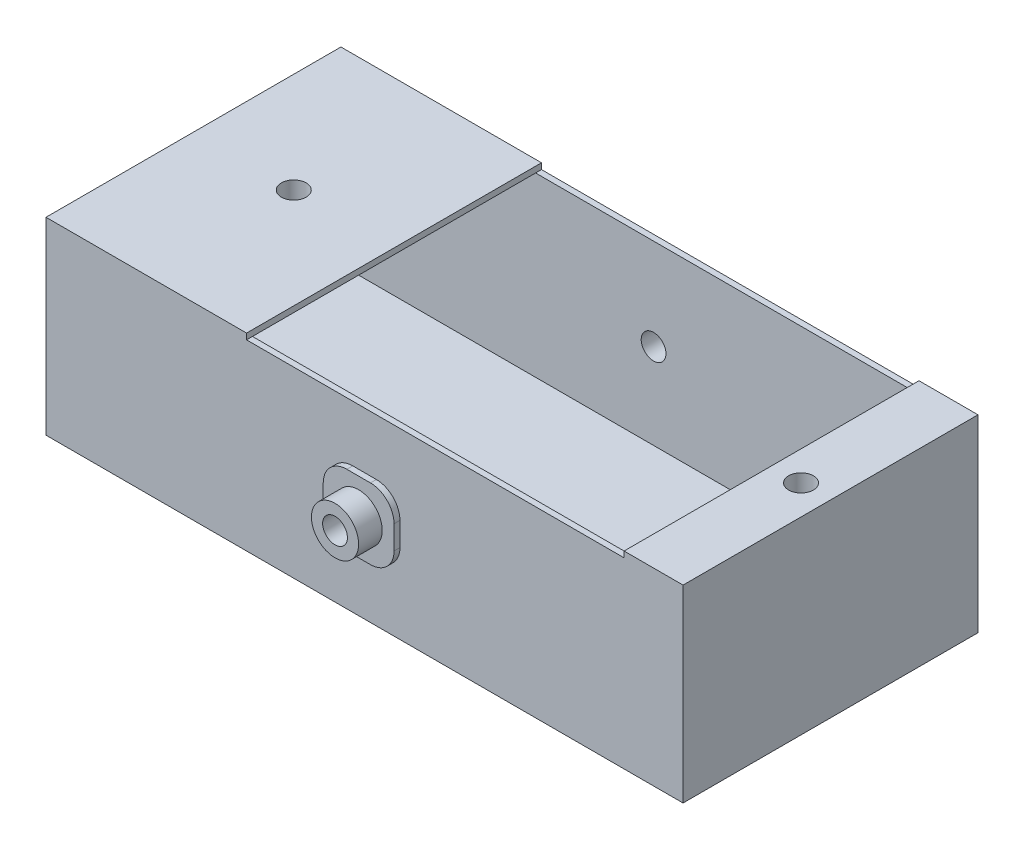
ISO-10303-21;
HEADER;
FILE_DESCRIPTION(('STEP AP214'),'2;1');
FILE_NAME('part.step','',(''),(''),'','','');
FILE_SCHEMA(('AUTOMOTIVE_DESIGN { 1 0 10303 214 1 1 1 1 }'));
ENDSEC;
DATA;
#1=APPLICATION_CONTEXT('core data for automotive mechanical design processes');
#2=APPLICATION_PROTOCOL_DEFINITION('international standard','automotive_design',2000,#1);
#3=PRODUCT_CONTEXT('',#1,'mechanical');
#4=PRODUCT('Part','Part','',(#3));
#5=PRODUCT_RELATED_PRODUCT_CATEGORY('part','',(#4));
#6=PRODUCT_DEFINITION_FORMATION('','',#4);
#7=PRODUCT_DEFINITION_CONTEXT('part definition',#1,'design');
#8=PRODUCT_DEFINITION('design','',#6,#7);
#9=PRODUCT_DEFINITION_SHAPE('','',#8);
#10=(LENGTH_UNIT() NAMED_UNIT(*) SI_UNIT(.MILLI.,.METRE.));
#11=(NAMED_UNIT(*) PLANE_ANGLE_UNIT() SI_UNIT($,.RADIAN.));
#12=(NAMED_UNIT(*) SI_UNIT($,.STERADIAN.) SOLID_ANGLE_UNIT());
#13=UNCERTAINTY_MEASURE_WITH_UNIT(LENGTH_MEASURE(1.E-05),#10,'distance_accuracy_value','');
#14=(GEOMETRIC_REPRESENTATION_CONTEXT(3) GLOBAL_UNCERTAINTY_ASSIGNED_CONTEXT((#13)) GLOBAL_UNIT_ASSIGNED_CONTEXT((#10,
#11,#12)) REPRESENTATION_CONTEXT('',''));
#15=CARTESIAN_POINT('',(0.,0.,0.));
#16=DIRECTION('',(0.,0.,1.));
#17=DIRECTION('',(1.,0.,0.));
#18=AXIS2_PLACEMENT_3D('',#15,#16,#17);
#19=CARTESIAN_POINT('',(-185.,130.,0.));
#20=DIRECTION('',(0.,1.,0.));
#21=DIRECTION('',(0.,0.,1.));
#22=AXIS2_PLACEMENT_3D('',#19,#20,#21);
#23=CYLINDRICAL_SURFACE('',#22,20.);
#24=CARTESIAN_POINT('',(-185.,130.,0.));
#25=DIRECTION('',(0.,1.,0.));
#26=DIRECTION('',(0.,0.,1.));
#27=AXIS2_PLACEMENT_3D('',#24,#25,#26);
#28=CIRCLE('',#27,20.);
#29=CARTESIAN_POINT('',(-185.,130.,20.));
#30=VERTEX_POINT('',#29);
#31=EDGE_CURVE('E364',#30,#30,#28,.T.);
#32=ORIENTED_EDGE('',*,*,#31,.T.);
#33=EDGE_LOOP('',(#32));
#34=FACE_BOUND('',#33,.T.);
#35=CARTESIAN_POINT('',(-185.,150.,0.));
#36=DIRECTION('',(0.,1.,0.));
#37=DIRECTION('',(0.,0.,1.));
#38=AXIS2_PLACEMENT_3D('',#35,#36,#37);
#39=CIRCLE('',#38,20.);
#40=CARTESIAN_POINT('',(-185.,150.,20.));
#41=VERTEX_POINT('',#40);
#42=EDGE_CURVE('E359',#41,#41,#39,.F.);
#43=ORIENTED_EDGE('',*,*,#42,.T.);
#44=EDGE_LOOP('',(#43));
#45=FACE_BOUND('',#44,.T.);
#46=ADVANCED_FACE('F41',(#34,#45),#23,.T.);
#47=CARTESIAN_POINT('',(270.,5.,125.));
#48=DIRECTION('',(0.,0.,-1.));
#49=DIRECTION('',(-1.,0.,0.));
#50=AXIS2_PLACEMENT_3D('',#47,#48,#49);
#51=PLANE('',#50);
#52=DIRECTION('',(1.,0.,0.));
#53=VECTOR('',#52,1.);
#54=CARTESIAN_POINT('',(270.,0.,125.));
#55=LINE('',#54,#53);
#56=CARTESIAN_POINT('',(-270.,0.,125.));
#57=VERTEX_POINT('',#56);
#58=CARTESIAN_POINT('',(270.,0.,125.));
#59=VERTEX_POINT('',#58);
#60=EDGE_CURVE('E532',#57,#59,#55,.T.);
#61=ORIENTED_EDGE('',*,*,#60,.T.);
#62=DIRECTION('',(0.,-1.,0.));
#63=VECTOR('',#62,1.);
#64=CARTESIAN_POINT('',(270.,5.,125.));
#65=LINE('',#64,#63);
#66=CARTESIAN_POINT('',(270.,160.,125.));
#67=VERTEX_POINT('',#66);
#68=EDGE_CURVE('E544',#67,#59,#65,.T.);
#69=ORIENTED_EDGE('',*,*,#68,.F.);
#70=DIRECTION('',(1.,0.,0.));
#71=VECTOR('',#70,1.);
#72=CARTESIAN_POINT('',(270.,160.,125.));
#73=LINE('',#72,#71);
#74=CARTESIAN_POINT('',(220.,160.,125.));
#75=VERTEX_POINT('',#74);
#76=EDGE_CURVE('E446',#75,#67,#73,.T.);
#77=ORIENTED_EDGE('',*,*,#76,.F.);
#78=DIRECTION('',(0.,-1.,0.));
#79=VECTOR('',#78,1.);
#80=CARTESIAN_POINT('',(220.,160.,125.));
#81=LINE('',#80,#79);
#82=CARTESIAN_POINT('',(220.,155.,125.));
#83=VERTEX_POINT('',#82);
#84=EDGE_CURVE('E443',#75,#83,#81,.T.);
#85=ORIENTED_EDGE('',*,*,#84,.T.);
#86=DIRECTION('',(1.,0.,0.));
#87=VECTOR('',#86,1.);
#88=CARTESIAN_POINT('',(-270.,155.,125.));
#89=LINE('',#88,#87);
#90=CARTESIAN_POINT('',(-100.,155.,125.));
#91=VERTEX_POINT('',#90);
#92=EDGE_CURVE('E524',#91,#83,#89,.T.);
#93=ORIENTED_EDGE('',*,*,#92,.F.);
#94=DIRECTION('',(0.,-1.,0.));
#95=VECTOR('',#94,1.);
#96=CARTESIAN_POINT('',(-99.9999999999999,160.,125.));
#97=LINE('',#96,#95);
#98=CARTESIAN_POINT('',(-99.9999999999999,160.,125.));
#99=VERTEX_POINT('',#98);
#100=EDGE_CURVE('E485',#99,#91,#97,.T.);
#101=ORIENTED_EDGE('',*,*,#100,.F.);
#102=DIRECTION('',(1.,0.,0.));
#103=VECTOR('',#102,1.);
#104=CARTESIAN_POINT('',(-270.,160.,125.));
#105=LINE('',#104,#103);
#106=CARTESIAN_POINT('',(-270.,160.,125.));
#107=VERTEX_POINT('',#106);
#108=EDGE_CURVE('E471',#107,#99,#105,.T.);
#109=ORIENTED_EDGE('',*,*,#108,.F.);
#110=DIRECTION('',(0.,-1.,0.));
#111=VECTOR('',#110,1.);
#112=CARTESIAN_POINT('',(-270.,5.,125.));
#113=LINE('',#112,#111);
#114=EDGE_CURVE('E547',#107,#57,#113,.T.);
#115=ORIENTED_EDGE('',*,*,#114,.T.);
#116=EDGE_LOOP('',(#61,#69,#77,#85,#93,#101,#109,#115));
#117=FACE_BOUND('',#116,.T.);
#118=DIRECTION('',(0.,-1.,0.));
#119=VECTOR('',#118,1.);
#120=CARTESIAN_POINT('',(-30.,47.5,125.));
#121=LINE('',#120,#119);
#122=CARTESIAN_POINT('',(-30.,87.5,125.));
#123=VERTEX_POINT('',#122);
#124=CARTESIAN_POINT('',(-30.,67.5,125.));
#125=VERTEX_POINT('',#124);
#126=EDGE_CURVE('E408',#123,#125,#121,.T.);
#127=ORIENTED_EDGE('',*,*,#126,.F.);
#128=CARTESIAN_POINT('',(-9.99999999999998,87.5,125.));
#129=DIRECTION('',(0.,0.,-1.));
#130=DIRECTION('',(-1.,0.,0.));
#131=AXIS2_PLACEMENT_3D('',#128,#129,#130);
#132=CIRCLE('',#131,20.);
#133=CARTESIAN_POINT('',(-9.99999999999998,107.5,125.));
#134=VERTEX_POINT('',#133);
#135=EDGE_CURVE('E580',#123,#134,#132,.T.);
#136=ORIENTED_EDGE('',*,*,#135,.T.);
#137=DIRECTION('',(-1.,0.,0.));
#138=VECTOR('',#137,1.);
#139=CARTESIAN_POINT('',(30.,107.5,125.));
#140=LINE('',#139,#138);
#141=CARTESIAN_POINT('',(10.,107.5,125.));
#142=VERTEX_POINT('',#141);
#143=EDGE_CURVE('E413',#142,#134,#140,.T.);
#144=ORIENTED_EDGE('',*,*,#143,.F.);
#145=CARTESIAN_POINT('',(10.,87.5,125.));
#146=DIRECTION('',(0.,0.,-1.));
#147=DIRECTION('',(-1.,0.,0.));
#148=AXIS2_PLACEMENT_3D('',#145,#146,#147);
#149=CIRCLE('',#148,20.);
#150=CARTESIAN_POINT('',(30.,87.5,125.));
#151=VERTEX_POINT('',#150);
#152=EDGE_CURVE('E402',#142,#151,#149,.T.);
#153=ORIENTED_EDGE('',*,*,#152,.T.);
#154=DIRECTION('',(0.,1.,0.));
#155=VECTOR('',#154,1.);
#156=CARTESIAN_POINT('',(30.,47.5,125.));
#157=LINE('',#156,#155);
#158=CARTESIAN_POINT('',(30.,67.5,125.));
#159=VERTEX_POINT('',#158);
#160=EDGE_CURVE('E428',#159,#151,#157,.T.);
#161=ORIENTED_EDGE('',*,*,#160,.F.);
#162=CARTESIAN_POINT('',(10.,67.5,125.));
#163=DIRECTION('',(0.,0.,-1.));
#164=DIRECTION('',(-1.,0.,0.));
#165=AXIS2_PLACEMENT_3D('',#162,#163,#164);
#166=CIRCLE('',#165,20.);
#167=CARTESIAN_POINT('',(10.,47.5,125.));
#168=VERTEX_POINT('',#167);
#169=EDGE_CURVE('E582',#159,#168,#166,.T.);
#170=ORIENTED_EDGE('',*,*,#169,.T.);
#171=DIRECTION('',(1.,0.,0.));
#172=VECTOR('',#171,1.);
#173=CARTESIAN_POINT('',(30.,47.5,125.));
#174=LINE('',#173,#172);
#175=CARTESIAN_POINT('',(-9.99999999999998,47.5,125.));
#176=VERTEX_POINT('',#175);
#177=EDGE_CURVE('E425',#176,#168,#174,.T.);
#178=ORIENTED_EDGE('',*,*,#177,.F.);
#179=CARTESIAN_POINT('',(-9.99999999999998,67.5,125.));
#180=DIRECTION('',(0.,0.,-1.));
#181=DIRECTION('',(-1.,0.,0.));
#182=AXIS2_PLACEMENT_3D('',#179,#180,#181);
#183=CIRCLE('',#182,20.);
#184=EDGE_CURVE('E578',#176,#125,#183,.T.);
#185=ORIENTED_EDGE('',*,*,#184,.T.);
#186=EDGE_LOOP('',(#127,#136,#144,#153,#161,#170,#178,#185));
#187=FACE_BOUND('',#186,.T.);
#188=ADVANCED_FACE('F735',(#117,#187),#51,.F.);
#189=CARTESIAN_POINT('',(0.,155.,0.));
#190=DIRECTION('',(0.,1.,0.));
#191=DIRECTION('',(0.,0.,1.));
#192=AXIS2_PLACEMENT_3D('',#189,#190,#191);
#193=PLANE('',#192);
#194=ORIENTED_EDGE('',*,*,#92,.T.);
#195=DIRECTION('',(0.,0.,1.));
#196=VECTOR('',#195,1.);
#197=CARTESIAN_POINT('',(220.,155.,-125.));
#198=LINE('',#197,#196);
#199=CARTESIAN_POINT('',(220.,155.,120.));
#200=VERTEX_POINT('',#199);
#201=EDGE_CURVE('E452',#200,#83,#198,.T.);
#202=ORIENTED_EDGE('',*,*,#201,.F.);
#203=DIRECTION('',(1.,0.,0.));
#204=VECTOR('',#203,1.);
#205=CARTESIAN_POINT('',(-265.,155.,120.));
#206=LINE('',#205,#204);
#207=CARTESIAN_POINT('',(-100.,155.,120.));
#208=VERTEX_POINT('',#207);
#209=EDGE_CURVE('E506',#208,#200,#206,.T.);
#210=ORIENTED_EDGE('',*,*,#209,.F.);
#211=DIRECTION('',(0.,0.,-1.));
#212=VECTOR('',#211,1.);
#213=CARTESIAN_POINT('',(-100.,155.,-125.));
#214=LINE('',#213,#212);
#215=EDGE_CURVE('E472',#91,#208,#214,.T.);
#216=ORIENTED_EDGE('',*,*,#215,.F.);
#217=EDGE_LOOP('',(#194,#202,#210,#216));
#218=FACE_BOUND('',#217,.T.);
#219=ADVANCED_FACE('F741',(#218),#193,.T.);
#220=DIRECTION('',(-1.,0.,0.));
#221=VECTOR('',#220,1.);
#222=CARTESIAN_POINT('',(265.,155.,-120.));
#223=LINE('',#222,#221);
#224=CARTESIAN_POINT('',(220.,155.,-120.));
#225=VERTEX_POINT('',#224);
#226=CARTESIAN_POINT('',(-100.,155.,-120.));
#227=VERTEX_POINT('',#226);
#228=EDGE_CURVE('E498',#225,#227,#223,.T.);
#229=ORIENTED_EDGE('',*,*,#228,.F.);
#230=CARTESIAN_POINT('',(220.,155.,-125.));
#231=VERTEX_POINT('',#230);
#232=EDGE_CURVE('E447',#231,#225,#198,.T.);
#233=ORIENTED_EDGE('',*,*,#232,.F.);
#234=DIRECTION('',(-1.,0.,0.));
#235=VECTOR('',#234,1.);
#236=CARTESIAN_POINT('',(270.,155.,-125.));
#237=LINE('',#236,#235);
#238=CARTESIAN_POINT('',(-100.,155.,-125.));
#239=VERTEX_POINT('',#238);
#240=EDGE_CURVE('E527',#231,#239,#237,.T.);
#241=ORIENTED_EDGE('',*,*,#240,.T.);
#242=EDGE_CURVE('E482',#227,#239,#214,.T.);
#243=ORIENTED_EDGE('',*,*,#242,.F.);
#244=EDGE_LOOP('',(#229,#233,#241,#243));
#245=FACE_BOUND('',#244,.T.);
#246=ADVANCED_FACE('F866',(#245),#193,.T.);
#247=CARTESIAN_POINT('',(-270.,5.,125.));
#248=DIRECTION('',(1.,0.,0.));
#249=DIRECTION('',(0.,0.,-1.));
#250=AXIS2_PLACEMENT_3D('',#247,#248,#249);
#251=PLANE('',#250);
#252=DIRECTION('',(0.,0.,1.));
#253=VECTOR('',#252,1.);
#254=CARTESIAN_POINT('',(-270.,0.,125.));
#255=LINE('',#254,#253);
#256=CARTESIAN_POINT('',(-270.,0.,-125.));
#257=VERTEX_POINT('',#256);
#258=EDGE_CURVE('E529',#257,#57,#255,.T.);
#259=ORIENTED_EDGE('',*,*,#258,.T.);
#260=ORIENTED_EDGE('',*,*,#114,.F.);
#261=DIRECTION('',(0.,0.,1.));
#262=VECTOR('',#261,1.);
#263=CARTESIAN_POINT('',(-270.,160.,-125.));
#264=LINE('',#263,#262);
#265=CARTESIAN_POINT('',(-270.,160.,-125.));
#266=VERTEX_POINT('',#265);
#267=EDGE_CURVE('E468',#266,#107,#264,.T.);
#268=ORIENTED_EDGE('',*,*,#267,.F.);
#269=DIRECTION('',(0.,-1.,0.));
#270=VECTOR('',#269,1.);
#271=CARTESIAN_POINT('',(-270.,5.,-125.));
#272=LINE('',#271,#270);
#273=EDGE_CURVE('E538',#266,#257,#272,.T.);
#274=ORIENTED_EDGE('',*,*,#273,.T.);
#275=EDGE_LOOP('',(#259,#260,#268,#274));
#276=FACE_BOUND('',#275,.T.);
#277=ADVANCED_FACE('F880',(#276),#251,.F.);
#278=CARTESIAN_POINT('',(270.,5.,125.));
#279=DIRECTION('',(-1.,0.,0.));
#280=DIRECTION('',(0.,0.,1.));
#281=AXIS2_PLACEMENT_3D('',#278,#279,#280);
#282=PLANE('',#281);
#283=DIRECTION('',(0.,0.,-1.));
#284=VECTOR('',#283,1.);
#285=CARTESIAN_POINT('',(270.,0.,125.));
#286=LINE('',#285,#284);
#287=CARTESIAN_POINT('',(270.,0.,-125.));
#288=VERTEX_POINT('',#287);
#289=EDGE_CURVE('E534',#59,#288,#286,.T.);
#290=ORIENTED_EDGE('',*,*,#289,.T.);
#291=DIRECTION('',(0.,-1.,0.));
#292=VECTOR('',#291,1.);
#293=CARTESIAN_POINT('',(270.,5.,-125.));
#294=LINE('',#293,#292);
#295=CARTESIAN_POINT('',(270.,160.,-125.));
#296=VERTEX_POINT('',#295);
#297=EDGE_CURVE('E541',#296,#288,#294,.T.);
#298=ORIENTED_EDGE('',*,*,#297,.F.);
#299=DIRECTION('',(0.,0.,-1.));
#300=VECTOR('',#299,1.);
#301=CARTESIAN_POINT('',(270.,160.,-125.));
#302=LINE('',#301,#300);
#303=EDGE_CURVE('E459',#67,#296,#302,.T.);
#304=ORIENTED_EDGE('',*,*,#303,.F.);
#305=ORIENTED_EDGE('',*,*,#68,.T.);
#306=EDGE_LOOP('',(#290,#298,#304,#305));
#307=FACE_BOUND('',#306,.T.);
#308=ADVANCED_FACE('F877',(#307),#282,.F.);
#309=CARTESIAN_POINT('',(270.,5.,-125.));
#310=DIRECTION('',(0.,0.,1.));
#311=DIRECTION('',(1.,0.,0.));
#312=AXIS2_PLACEMENT_3D('',#309,#310,#311);
#313=PLANE('',#312);
#314=DIRECTION('',(0.,1.,0.));
#315=VECTOR('',#314,1.);
#316=CARTESIAN_POINT('',(30.,47.5,-125.));
#317=LINE('',#316,#315);
#318=CARTESIAN_POINT('',(30.,67.5,-125.));
#319=VERTEX_POINT('',#318);
#320=CARTESIAN_POINT('',(30.,87.5,-125.));
#321=VERTEX_POINT('',#320);
#322=EDGE_CURVE('E393',#319,#321,#317,.T.);
#323=ORIENTED_EDGE('',*,*,#322,.T.);
#324=CARTESIAN_POINT('',(10.,87.5,-125.));
#325=DIRECTION('',(0.,0.,1.));
#326=DIRECTION('',(1.,0.,0.));
#327=AXIS2_PLACEMENT_3D('',#324,#325,#326);
#328=CIRCLE('',#327,20.);
#329=CARTESIAN_POINT('',(10.,107.5,-125.));
#330=VERTEX_POINT('',#329);
#331=EDGE_CURVE('E616',#321,#330,#328,.T.);
#332=ORIENTED_EDGE('',*,*,#331,.T.);
#333=DIRECTION('',(-1.,0.,0.));
#334=VECTOR('',#333,1.);
#335=CARTESIAN_POINT('',(30.,107.5,-125.));
#336=LINE('',#335,#334);
#337=CARTESIAN_POINT('',(-9.99999999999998,107.5,-125.));
#338=VERTEX_POINT('',#337);
#339=EDGE_CURVE('E390',#330,#338,#336,.T.);
#340=ORIENTED_EDGE('',*,*,#339,.T.);
#341=CARTESIAN_POINT('',(-9.99999999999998,87.5,-125.));
#342=DIRECTION('',(0.,0.,1.));
#343=DIRECTION('',(1.,0.,0.));
#344=AXIS2_PLACEMENT_3D('',#341,#342,#343);
#345=CIRCLE('',#344,20.);
#346=CARTESIAN_POINT('',(-30.,87.5,-125.));
#347=VERTEX_POINT('',#346);
#348=EDGE_CURVE('E618',#338,#347,#345,.T.);
#349=ORIENTED_EDGE('',*,*,#348,.T.);
#350=DIRECTION('',(0.,-1.,0.));
#351=VECTOR('',#350,1.);
#352=CARTESIAN_POINT('',(-30.,47.5,-125.));
#353=LINE('',#352,#351);
#354=CARTESIAN_POINT('',(-30.,67.5,-125.));
#355=VERTEX_POINT('',#354);
#356=EDGE_CURVE('E373',#347,#355,#353,.T.);
#357=ORIENTED_EDGE('',*,*,#356,.T.);
#358=CARTESIAN_POINT('',(-9.99999999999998,67.5,-125.));
#359=DIRECTION('',(0.,0.,1.));
#360=DIRECTION('',(1.,0.,0.));
#361=AXIS2_PLACEMENT_3D('',#358,#359,#360);
#362=CIRCLE('',#361,20.);
#363=CARTESIAN_POINT('',(-9.99999999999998,47.5,-125.));
#364=VERTEX_POINT('',#363);
#365=EDGE_CURVE('E614',#355,#364,#362,.T.);
#366=ORIENTED_EDGE('',*,*,#365,.T.);
#367=DIRECTION('',(1.,0.,0.));
#368=VECTOR('',#367,1.);
#369=CARTESIAN_POINT('',(30.,47.5,-125.));
#370=LINE('',#369,#368);
#371=CARTESIAN_POINT('',(10.,47.5,-125.));
#372=VERTEX_POINT('',#371);
#373=EDGE_CURVE('E378',#364,#372,#370,.T.);
#374=ORIENTED_EDGE('',*,*,#373,.T.);
#375=CARTESIAN_POINT('',(10.,67.5,-125.));
#376=DIRECTION('',(0.,0.,1.));
#377=DIRECTION('',(1.,0.,0.));
#378=AXIS2_PLACEMENT_3D('',#375,#376,#377);
#379=CIRCLE('',#378,20.);
#380=EDGE_CURVE('E612',#372,#319,#379,.T.);
#381=ORIENTED_EDGE('',*,*,#380,.T.);
#382=EDGE_LOOP('',(#323,#332,#340,#349,#357,#366,#374,#381));
#383=FACE_BOUND('',#382,.T.);
#384=DIRECTION('',(-1.,0.,0.));
#385=VECTOR('',#384,1.);
#386=CARTESIAN_POINT('',(270.,0.,-125.));
#387=LINE('',#386,#385);
#388=EDGE_CURVE('E536',#288,#257,#387,.T.);
#389=ORIENTED_EDGE('',*,*,#388,.T.);
#390=ORIENTED_EDGE('',*,*,#273,.F.);
#391=DIRECTION('',(-1.,0.,0.));
#392=VECTOR('',#391,1.);
#393=CARTESIAN_POINT('',(-270.,160.,-125.));
#394=LINE('',#393,#392);
#395=CARTESIAN_POINT('',(-100.,160.,-125.));
#396=VERTEX_POINT('',#395);
#397=EDGE_CURVE('E476',#396,#266,#394,.T.);
#398=ORIENTED_EDGE('',*,*,#397,.F.);
#399=DIRECTION('',(0.,-1.,0.));
#400=VECTOR('',#399,1.);
#401=CARTESIAN_POINT('',(-100.,160.,-125.));
#402=LINE('',#401,#400);
#403=EDGE_CURVE('E479',#396,#239,#402,.T.);
#404=ORIENTED_EDGE('',*,*,#403,.T.);
#405=ORIENTED_EDGE('',*,*,#240,.F.);
#406=DIRECTION('',(0.,-1.,0.));
#407=VECTOR('',#406,1.);
#408=CARTESIAN_POINT('',(220.,160.,-125.));
#409=LINE('',#408,#407);
#410=CARTESIAN_POINT('',(220.,160.,-125.));
#411=VERTEX_POINT('',#410);
#412=EDGE_CURVE('E441',#411,#231,#409,.T.);
#413=ORIENTED_EDGE('',*,*,#412,.F.);
#414=DIRECTION('',(-1.,0.,0.));
#415=VECTOR('',#414,1.);
#416=CARTESIAN_POINT('',(270.,160.,-125.));
#417=LINE('',#416,#415);
#418=EDGE_CURVE('E457',#296,#411,#417,.T.);
#419=ORIENTED_EDGE('',*,*,#418,.F.);
#420=ORIENTED_EDGE('',*,*,#297,.T.);
#421=EDGE_LOOP('',(#389,#390,#398,#404,#405,#413,#419,#420));
#422=FACE_BOUND('',#421,.T.);
#423=ADVANCED_FACE('F873',(#383,#422),#313,.F.);
#424=CARTESIAN_POINT('',(0.,0.,0.));
#425=DIRECTION('',(0.,1.,0.));
#426=DIRECTION('',(0.,0.,1.));
#427=AXIS2_PLACEMENT_3D('',#424,#425,#426);
#428=PLANE('',#427);
#429=ORIENTED_EDGE('',*,*,#258,.F.);
#430=ORIENTED_EDGE('',*,*,#388,.F.);
#431=ORIENTED_EDGE('',*,*,#289,.F.);
#432=ORIENTED_EDGE('',*,*,#60,.F.);
#433=EDGE_LOOP('',(#429,#430,#431,#432));
#434=FACE_BOUND('',#433,.T.);
#435=ADVANCED_FACE('F862',(#434),#428,.F.);
#436=CARTESIAN_POINT('',(265.,155.,120.));
#437=DIRECTION('',(-1.,0.,0.));
#438=DIRECTION('',(0.,0.,1.));
#439=AXIS2_PLACEMENT_3D('',#436,#437,#438);
#440=PLANE('',#439);
#441=DIRECTION('',(0.,0.,-1.));
#442=VECTOR('',#441,1.);
#443=CARTESIAN_POINT('',(265.,5.,120.));
#444=LINE('',#443,#442);
#445=CARTESIAN_POINT('',(265.,5.,120.));
#446=VERTEX_POINT('',#445);
#447=CARTESIAN_POINT('',(265.,5.,-120.));
#448=VERTEX_POINT('',#447);
#449=EDGE_CURVE('E488',#446,#448,#444,.T.);
#450=ORIENTED_EDGE('',*,*,#449,.F.);
#451=DIRECTION('',(0.,-1.,0.));
#452=VECTOR('',#451,1.);
#453=CARTESIAN_POINT('',(265.,155.,120.));
#454=LINE('',#453,#452);
#455=CARTESIAN_POINT('',(265.,155.,120.));
#456=VERTEX_POINT('',#455);
#457=EDGE_CURVE('E505',#456,#446,#454,.T.);
#458=ORIENTED_EDGE('',*,*,#457,.F.);
#459=DIRECTION('',(0.,0.,-1.));
#460=VECTOR('',#459,1.);
#461=CARTESIAN_POINT('',(265.,155.,120.));
#462=LINE('',#461,#460);
#463=CARTESIAN_POINT('',(265.,155.,-120.));
#464=VERTEX_POINT('',#463);
#465=EDGE_CURVE('E489',#456,#464,#462,.T.);
#466=ORIENTED_EDGE('',*,*,#465,.T.);
#467=DIRECTION('',(0.,-1.,0.));
#468=VECTOR('',#467,1.);
#469=CARTESIAN_POINT('',(265.,155.,-120.));
#470=LINE('',#469,#468);
#471=EDGE_CURVE('E521',#464,#448,#470,.T.);
#472=ORIENTED_EDGE('',*,*,#471,.T.);
#473=EDGE_LOOP('',(#450,#458,#466,#472));
#474=FACE_BOUND('',#473,.T.);
#475=ADVANCED_FACE('F858',(#474),#440,.T.);
#476=CARTESIAN_POINT('',(265.,155.,-120.));
#477=DIRECTION('',(0.,0.,1.));
#478=DIRECTION('',(1.,0.,0.));
#479=AXIS2_PLACEMENT_3D('',#476,#477,#478);
#480=PLANE('',#479);
#481=CARTESIAN_POINT('',(0.,77.5,-120.));
#482=DIRECTION('',(0.,0.,1.));
#483=DIRECTION('',(1.,0.,0.));
#484=AXIS2_PLACEMENT_3D('',#481,#482,#483);
#485=CIRCLE('',#484,10.5);
#486=CARTESIAN_POINT('',(10.5,77.5,-120.));
#487=VERTEX_POINT('',#486);
#488=EDGE_CURVE('E370',#487,#487,#485,.T.);
#489=ORIENTED_EDGE('',*,*,#488,.F.);
#490=EDGE_LOOP('',(#489));
#491=FACE_BOUND('',#490,.T.);
#492=DIRECTION('',(-1.,0.,0.));
#493=VECTOR('',#492,1.);
#494=CARTESIAN_POINT('',(265.,5.,-120.));
#495=LINE('',#494,#493);
#496=CARTESIAN_POINT('',(-265.,5.,-120.));
#497=VERTEX_POINT('',#496);
#498=EDGE_CURVE('E508',#448,#497,#495,.T.);
#499=ORIENTED_EDGE('',*,*,#498,.F.);
#500=ORIENTED_EDGE('',*,*,#471,.F.);
#501=EDGE_CURVE('E494',#464,#225,#223,.T.);
#502=ORIENTED_EDGE('',*,*,#501,.T.);
#503=ORIENTED_EDGE('',*,*,#228,.T.);
#504=CARTESIAN_POINT('',(-265.,155.,-120.));
#505=VERTEX_POINT('',#504);
#506=EDGE_CURVE('E492',#227,#505,#223,.T.);
#507=ORIENTED_EDGE('',*,*,#506,.T.);
#508=DIRECTION('',(0.,-1.,0.));
#509=VECTOR('',#508,1.);
#510=CARTESIAN_POINT('',(-265.,155.,-120.));
#511=LINE('',#510,#509);
#512=EDGE_CURVE('E518',#505,#497,#511,.T.);
#513=ORIENTED_EDGE('',*,*,#512,.T.);
#514=EDGE_LOOP('',(#499,#500,#502,#503,#507,#513));
#515=FACE_BOUND('',#514,.T.);
#516=ADVANCED_FACE('F854',(#491,#515),#480,.T.);
#517=CARTESIAN_POINT('',(-265.,155.,-120.));
#518=DIRECTION('',(1.,0.,0.));
#519=DIRECTION('',(0.,0.,-1.));
#520=AXIS2_PLACEMENT_3D('',#517,#518,#519);
#521=PLANE('',#520);
#522=DIRECTION('',(0.,0.,1.));
#523=VECTOR('',#522,1.);
#524=CARTESIAN_POINT('',(-265.,5.,-120.));
#525=LINE('',#524,#523);
#526=CARTESIAN_POINT('',(-265.,5.,120.));
#527=VERTEX_POINT('',#526);
#528=EDGE_CURVE('E510',#497,#527,#525,.T.);
#529=ORIENTED_EDGE('',*,*,#528,.F.);
#530=ORIENTED_EDGE('',*,*,#512,.F.);
#531=DIRECTION('',(0.,0.,1.));
#532=VECTOR('',#531,1.);
#533=CARTESIAN_POINT('',(-265.,155.,-120.));
#534=LINE('',#533,#532);
#535=CARTESIAN_POINT('',(-265.,155.,120.));
#536=VERTEX_POINT('',#535);
#537=EDGE_CURVE('E497',#505,#536,#534,.T.);
#538=ORIENTED_EDGE('',*,*,#537,.T.);
#539=DIRECTION('',(0.,-1.,0.));
#540=VECTOR('',#539,1.);
#541=CARTESIAN_POINT('',(-265.,155.,120.));
#542=LINE('',#541,#540);
#543=EDGE_CURVE('E515',#536,#527,#542,.T.);
#544=ORIENTED_EDGE('',*,*,#543,.T.);
#545=EDGE_LOOP('',(#529,#530,#538,#544));
#546=FACE_BOUND('',#545,.T.);
#547=ADVANCED_FACE('F850',(#546),#521,.T.);
#548=CARTESIAN_POINT('',(-265.,155.,120.));
#549=DIRECTION('',(0.,0.,-1.));
#550=DIRECTION('',(-1.,0.,0.));
#551=AXIS2_PLACEMENT_3D('',#548,#549,#550);
#552=PLANE('',#551);
#553=CARTESIAN_POINT('',(0.,77.5,120.));
#554=DIRECTION('',(0.,0.,-1.));
#555=DIRECTION('',(-1.,0.,0.));
#556=AXIS2_PLACEMENT_3D('',#553,#554,#555);
#557=CIRCLE('',#556,10.5);
#558=CARTESIAN_POINT('',(-10.5,77.5,120.));
#559=VERTEX_POINT('',#558);
#560=EDGE_CURVE('E367',#559,#559,#557,.T.);
#561=ORIENTED_EDGE('',*,*,#560,.F.);
#562=EDGE_LOOP('',(#561));
#563=FACE_BOUND('',#562,.T.);
#564=DIRECTION('',(1.,0.,0.));
#565=VECTOR('',#564,1.);
#566=CARTESIAN_POINT('',(-265.,5.,120.));
#567=LINE('',#566,#565);
#568=EDGE_CURVE('E493',#527,#446,#567,.T.);
#569=ORIENTED_EDGE('',*,*,#568,.F.);
#570=ORIENTED_EDGE('',*,*,#543,.F.);
#571=EDGE_CURVE('E502',#536,#208,#206,.T.);
#572=ORIENTED_EDGE('',*,*,#571,.T.);
#573=ORIENTED_EDGE('',*,*,#209,.T.);
#574=EDGE_CURVE('E501',#200,#456,#206,.T.);
#575=ORIENTED_EDGE('',*,*,#574,.T.);
#576=ORIENTED_EDGE('',*,*,#457,.T.);
#577=EDGE_LOOP('',(#569,#570,#572,#573,#575,#576));
#578=FACE_BOUND('',#577,.T.);
#579=ADVANCED_FACE('F847',(#563,#578),#552,.T.);
#580=CARTESIAN_POINT('',(0.,5.,0.));
#581=DIRECTION('',(0.,1.,0.));
#582=DIRECTION('',(0.,0.,1.));
#583=AXIS2_PLACEMENT_3D('',#580,#581,#582);
#584=PLANE('',#583);
#585=ORIENTED_EDGE('',*,*,#449,.T.);
#586=ORIENTED_EDGE('',*,*,#498,.T.);
#587=ORIENTED_EDGE('',*,*,#528,.T.);
#588=ORIENTED_EDGE('',*,*,#568,.T.);
#589=EDGE_LOOP('',(#585,#586,#587,#588));
#590=FACE_BOUND('',#589,.T.);
#591=ADVANCED_FACE('F839',(#590),#584,.T.);
#592=CARTESIAN_POINT('',(0.,160.,0.));
#593=DIRECTION('',(0.,1.,0.));
#594=DIRECTION('',(0.,0.,1.));
#595=AXIS2_PLACEMENT_3D('',#592,#593,#594);
#596=PLANE('',#595);
#597=ORIENTED_EDGE('',*,*,#267,.T.);
#598=ORIENTED_EDGE('',*,*,#108,.T.);
#599=DIRECTION('',(0.,0.,-1.));
#600=VECTOR('',#599,1.);
#601=CARTESIAN_POINT('',(-100.,160.,-125.));
#602=LINE('',#601,#600);
#603=EDGE_CURVE('E474',#99,#396,#602,.T.);
#604=ORIENTED_EDGE('',*,*,#603,.T.);
#605=ORIENTED_EDGE('',*,*,#397,.T.);
#606=EDGE_LOOP('',(#597,#598,#604,#605));
#607=FACE_BOUND('',#606,.T.);
#608=CARTESIAN_POINT('',(-185.,160.,0.));
#609=DIRECTION('',(0.,1.,0.));
#610=DIRECTION('',(0.,0.,1.));
#611=AXIS2_PLACEMENT_3D('',#608,#609,#610);
#612=CIRCLE('',#611,10.5);
#613=CARTESIAN_POINT('',(-185.,160.,10.5));
#614=VERTEX_POINT('',#613);
#615=EDGE_CURVE('E464',#614,#614,#612,.T.);
#616=ORIENTED_EDGE('',*,*,#615,.F.);
#617=EDGE_LOOP('',(#616));
#618=FACE_BOUND('',#617,.T.);
#619=ADVANCED_FACE('F835',(#607,#618),#596,.T.);
#620=CARTESIAN_POINT('',(0.,155.,0.));
#621=DIRECTION('',(0.,1.,0.));
#622=DIRECTION('',(0.,0.,1.));
#623=AXIS2_PLACEMENT_3D('',#620,#621,#622);
#624=PLANE('',#623);
#625=DIRECTION('',(0.,0.,-1.));
#626=VECTOR('',#625,1.);
#627=CARTESIAN_POINT('',(-155.,155.,0.));
#628=LINE('',#627,#626);
#629=CARTESIAN_POINT('',(-155.,155.,25.));
#630=VERTEX_POINT('',#629);
#631=CARTESIAN_POINT('',(-155.,155.,-25.));
#632=VERTEX_POINT('',#631);
#633=EDGE_CURVE('E623',#630,#632,#628,.T.);
#634=ORIENTED_EDGE('',*,*,#633,.T.);
#635=CARTESIAN_POINT('',(-160.,155.,-25.));
#636=DIRECTION('',(0.,1.,0.));
#637=DIRECTION('',(0.,0.,1.));
#638=AXIS2_PLACEMENT_3D('',#635,#636,#637);
#639=CIRCLE('',#638,5.);
#640=CARTESIAN_POINT('',(-160.,155.,-30.));
#641=VERTEX_POINT('',#640);
#642=EDGE_CURVE('E682',#632,#641,#639,.T.);
#643=ORIENTED_EDGE('',*,*,#642,.T.);
#644=DIRECTION('',(-1.,0.,0.));
#645=VECTOR('',#644,1.);
#646=CARTESIAN_POINT('',(0.,155.,-30.));
#647=LINE('',#646,#645);
#648=CARTESIAN_POINT('',(-215.,155.,-30.));
#649=VERTEX_POINT('',#648);
#650=EDGE_CURVE('E626',#641,#649,#647,.T.);
#651=ORIENTED_EDGE('',*,*,#650,.T.);
#652=DIRECTION('',(0.,0.,1.));
#653=VECTOR('',#652,1.);
#654=CARTESIAN_POINT('',(-215.,155.,0.));
#655=LINE('',#654,#653);
#656=CARTESIAN_POINT('',(-215.,155.,30.));
#657=VERTEX_POINT('',#656);
#658=EDGE_CURVE('E628',#649,#657,#655,.T.);
#659=ORIENTED_EDGE('',*,*,#658,.T.);
#660=DIRECTION('',(1.,0.,0.));
#661=VECTOR('',#660,1.);
#662=CARTESIAN_POINT('',(0.,155.,30.));
#663=LINE('',#662,#661);
#664=CARTESIAN_POINT('',(-160.,155.,30.));
#665=VERTEX_POINT('',#664);
#666=EDGE_CURVE('E328',#657,#665,#663,.T.);
#667=ORIENTED_EDGE('',*,*,#666,.T.);
#668=CARTESIAN_POINT('',(-160.,155.,25.));
#669=DIRECTION('',(0.,1.,0.));
#670=DIRECTION('',(0.,0.,1.));
#671=AXIS2_PLACEMENT_3D('',#668,#669,#670);
#672=CIRCLE('',#671,5.);
#673=EDGE_CURVE('E680',#665,#630,#672,.T.);
#674=ORIENTED_EDGE('',*,*,#673,.T.);
#675=EDGE_LOOP('',(#634,#643,#651,#659,#667,#674));
#676=FACE_BOUND('',#675,.T.);
#677=ORIENTED_EDGE('',*,*,#506,.F.);
#678=EDGE_CURVE('E467',#208,#227,#214,.T.);
#679=ORIENTED_EDGE('',*,*,#678,.F.);
#680=ORIENTED_EDGE('',*,*,#571,.F.);
#681=ORIENTED_EDGE('',*,*,#537,.F.);
#682=EDGE_LOOP('',(#677,#679,#680,#681));
#683=FACE_BOUND('',#682,.T.);
#684=ADVANCED_FACE('F838',(#676,#683),#624,.F.);
#685=CARTESIAN_POINT('',(-100.,160.,-125.));
#686=DIRECTION('',(-1.,0.,0.));
#687=DIRECTION('',(0.,0.,1.));
#688=AXIS2_PLACEMENT_3D('',#685,#686,#687);
#689=PLANE('',#688);
#690=ORIENTED_EDGE('',*,*,#215,.T.);
#691=ORIENTED_EDGE('',*,*,#678,.T.);
#692=ORIENTED_EDGE('',*,*,#242,.T.);
#693=ORIENTED_EDGE('',*,*,#403,.F.);
#694=ORIENTED_EDGE('',*,*,#603,.F.);
#695=ORIENTED_EDGE('',*,*,#100,.T.);
#696=EDGE_LOOP('',(#690,#691,#692,#693,#694,#695));
#697=FACE_BOUND('',#696,.T.);
#698=ADVANCED_FACE('F833',(#697),#689,.F.);
#699=CARTESIAN_POINT('',(-185.,160.,0.));
#700=DIRECTION('',(0.,-1.,0.));
#701=DIRECTION('',(0.,0.,-1.));
#702=AXIS2_PLACEMENT_3D('',#699,#700,#701);
#703=CYLINDRICAL_SURFACE('',#702,10.5);
#704=ORIENTED_EDGE('',*,*,#615,.T.);
#705=EDGE_LOOP('',(#704));
#706=FACE_BOUND('',#705,.T.);
#707=CARTESIAN_POINT('',(-185.,130.,0.));
#708=DIRECTION('',(0.,1.,0.));
#709=DIRECTION('',(0.,0.,1.));
#710=AXIS2_PLACEMENT_3D('',#707,#708,#709);
#711=CIRCLE('',#710,10.5);
#712=CARTESIAN_POINT('',(-185.,130.,10.5));
#713=VERTEX_POINT('',#712);
#714=EDGE_CURVE('E361',#713,#713,#711,.T.);
#715=ORIENTED_EDGE('',*,*,#714,.F.);
#716=EDGE_LOOP('',(#715));
#717=FACE_BOUND('',#716,.T.);
#718=ADVANCED_FACE('F826',(#706,#717),#703,.F.);
#719=CARTESIAN_POINT('',(0.,160.,0.));
#720=DIRECTION('',(0.,-1.,0.));
#721=DIRECTION('',(0.,0.,-1.));
#722=AXIS2_PLACEMENT_3D('',#719,#720,#721);
#723=PLANE('',#722);
#724=ORIENTED_EDGE('',*,*,#303,.T.);
#725=ORIENTED_EDGE('',*,*,#418,.T.);
#726=DIRECTION('',(0.,0.,1.));
#727=VECTOR('',#726,1.);
#728=CARTESIAN_POINT('',(220.,160.,-125.));
#729=LINE('',#728,#727);
#730=EDGE_CURVE('E455',#411,#75,#729,.T.);
#731=ORIENTED_EDGE('',*,*,#730,.T.);
#732=ORIENTED_EDGE('',*,*,#76,.T.);
#733=EDGE_LOOP('',(#724,#725,#731,#732));
#734=FACE_BOUND('',#733,.T.);
#735=CARTESIAN_POINT('',(245.,160.,-2.22044604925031E-13));
#736=DIRECTION('',(0.,1.,0.));
#737=DIRECTION('',(0.,0.,1.));
#738=AXIS2_PLACEMENT_3D('',#735,#736,#737);
#739=CIRCLE('',#738,10.5);
#740=CARTESIAN_POINT('',(245.,160.,10.4999999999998));
#741=VERTEX_POINT('',#740);
#742=EDGE_CURVE('E450',#741,#741,#739,.T.);
#743=ORIENTED_EDGE('',*,*,#742,.F.);
#744=EDGE_LOOP('',(#743));
#745=FACE_BOUND('',#744,.T.);
#746=ADVANCED_FACE('F823',(#734,#745),#723,.F.);
#747=CARTESIAN_POINT('',(0.,155.,0.));
#748=DIRECTION('',(0.,-1.,0.));
#749=DIRECTION('',(0.,0.,-1.));
#750=AXIS2_PLACEMENT_3D('',#747,#748,#749);
#751=PLANE('',#750);
#752=DIRECTION('',(0.,0.,-1.));
#753=VECTOR('',#752,1.);
#754=CARTESIAN_POINT('',(230.,155.,0.));
#755=LINE('',#754,#753);
#756=CARTESIAN_POINT('',(230.,155.,19.9999999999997));
#757=VERTEX_POINT('',#756);
#758=CARTESIAN_POINT('',(230.,155.,-20.0000000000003));
#759=VERTEX_POINT('',#758);
#760=EDGE_CURVE('E639',#757,#759,#755,.T.);
#761=ORIENTED_EDGE('',*,*,#760,.F.);
#762=CARTESIAN_POINT('',(235.,155.,19.9999999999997));
#763=DIRECTION('',(0.,-1.,0.));
#764=DIRECTION('',(0.,0.,-1.));
#765=AXIS2_PLACEMENT_3D('',#762,#763,#764);
#766=CIRCLE('',#765,5.);
#767=CARTESIAN_POINT('',(235.,155.,24.9999999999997));
#768=VERTEX_POINT('',#767);
#769=EDGE_CURVE('E49',#757,#768,#766,.F.);
#770=ORIENTED_EDGE('',*,*,#769,.T.);
#771=DIRECTION('',(-1.,0.,0.));
#772=VECTOR('',#771,1.);
#773=CARTESIAN_POINT('',(0.,155.,24.9999999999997));
#774=LINE('',#773,#772);
#775=CARTESIAN_POINT('',(255.,155.,24.9999999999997));
#776=VERTEX_POINT('',#775);
#777=EDGE_CURVE('E630',#776,#768,#774,.T.);
#778=ORIENTED_EDGE('',*,*,#777,.F.);
#779=CARTESIAN_POINT('',(255.,155.,19.9999999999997));
#780=DIRECTION('',(0.,-1.,0.));
#781=DIRECTION('',(0.,0.,-1.));
#782=AXIS2_PLACEMENT_3D('',#779,#780,#781);
#783=CIRCLE('',#782,5.);
#784=CARTESIAN_POINT('',(260.,155.,19.9999999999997));
#785=VERTEX_POINT('',#784);
#786=EDGE_CURVE('E686',#776,#785,#783,.F.);
#787=ORIENTED_EDGE('',*,*,#786,.T.);
#788=DIRECTION('',(0.,0.,1.));
#789=VECTOR('',#788,1.);
#790=CARTESIAN_POINT('',(260.,155.,0.));
#791=LINE('',#790,#789);
#792=CARTESIAN_POINT('',(260.,155.,-20.0000000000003));
#793=VERTEX_POINT('',#792);
#794=EDGE_CURVE('E633',#793,#785,#791,.T.);
#795=ORIENTED_EDGE('',*,*,#794,.F.);
#796=CARTESIAN_POINT('',(255.,155.,-20.0000000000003));
#797=DIRECTION('',(0.,-1.,0.));
#798=DIRECTION('',(0.,0.,-1.));
#799=AXIS2_PLACEMENT_3D('',#796,#797,#798);
#800=CIRCLE('',#799,5.);
#801=CARTESIAN_POINT('',(255.,155.,-25.0000000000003));
#802=VERTEX_POINT('',#801);
#803=EDGE_CURVE('E684',#793,#802,#800,.F.);
#804=ORIENTED_EDGE('',*,*,#803,.T.);
#805=DIRECTION('',(1.,0.,0.));
#806=VECTOR('',#805,1.);
#807=CARTESIAN_POINT('',(0.,155.,-25.0000000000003));
#808=LINE('',#807,#806);
#809=CARTESIAN_POINT('',(235.,155.,-25.0000000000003));
#810=VERTEX_POINT('',#809);
#811=EDGE_CURVE('E636',#810,#802,#808,.T.);
#812=ORIENTED_EDGE('',*,*,#811,.F.);
#813=CARTESIAN_POINT('',(235.,155.,-20.0000000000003));
#814=DIRECTION('',(0.,-1.,0.));
#815=DIRECTION('',(0.,0.,-1.));
#816=AXIS2_PLACEMENT_3D('',#813,#814,#815);
#817=CIRCLE('',#816,5.);
#818=EDGE_CURVE('E11',#810,#759,#817,.F.);
#819=ORIENTED_EDGE('',*,*,#818,.T.);
#820=EDGE_LOOP('',(#761,#770,#778,#787,#795,#804,#812,#819));
#821=FACE_BOUND('',#820,.T.);
#822=EDGE_CURVE('E451',#225,#200,#198,.T.);
#823=ORIENTED_EDGE('',*,*,#822,.F.);
#824=ORIENTED_EDGE('',*,*,#501,.F.);
#825=ORIENTED_EDGE('',*,*,#465,.F.);
#826=ORIENTED_EDGE('',*,*,#574,.F.);
#827=EDGE_LOOP('',(#823,#824,#825,#826));
#828=FACE_BOUND('',#827,.T.);
#829=ADVANCED_FACE('F688',(#821,#828),#751,.T.);
#830=CARTESIAN_POINT('',(220.,160.,-125.));
#831=DIRECTION('',(1.,0.,0.));
#832=DIRECTION('',(0.,0.,-1.));
#833=AXIS2_PLACEMENT_3D('',#830,#831,#832);
#834=PLANE('',#833);
#835=ORIENTED_EDGE('',*,*,#232,.T.);
#836=ORIENTED_EDGE('',*,*,#822,.T.);
#837=ORIENTED_EDGE('',*,*,#201,.T.);
#838=ORIENTED_EDGE('',*,*,#84,.F.);
#839=ORIENTED_EDGE('',*,*,#730,.F.);
#840=ORIENTED_EDGE('',*,*,#412,.T.);
#841=EDGE_LOOP('',(#835,#836,#837,#838,#839,#840));
#842=FACE_BOUND('',#841,.T.);
#843=ADVANCED_FACE('F817',(#842),#834,.F.);
#844=CARTESIAN_POINT('',(245.,160.,-2.22044604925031E-13));
#845=DIRECTION('',(0.,-1.,0.));
#846=DIRECTION('',(0.,0.,-1.));
#847=AXIS2_PLACEMENT_3D('',#844,#845,#846);
#848=CYLINDRICAL_SURFACE('',#847,10.5);
#849=ORIENTED_EDGE('',*,*,#742,.T.);
#850=EDGE_LOOP('',(#849));
#851=FACE_BOUND('',#850,.T.);
#852=CARTESIAN_POINT('',(245.,135.,-2.22044604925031E-13));
#853=DIRECTION('',(0.,1.,0.));
#854=DIRECTION('',(0.,0.,1.));
#855=AXIS2_PLACEMENT_3D('',#852,#853,#854);
#856=CIRCLE('',#855,10.5);
#857=CARTESIAN_POINT('',(245.,135.,10.4999999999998));
#858=VERTEX_POINT('',#857);
#859=EDGE_CURVE('E708',#858,#858,#856,.T.);
#860=ORIENTED_EDGE('',*,*,#859,.F.);
#861=EDGE_LOOP('',(#860));
#862=FACE_BOUND('',#861,.T.);
#863=ADVANCED_FACE('F803',(#851,#862),#848,.F.);
#864=CARTESIAN_POINT('',(-30.,47.5,130.));
#865=DIRECTION('',(1.,0.,0.));
#866=DIRECTION('',(0.,0.,-1.));
#867=AXIS2_PLACEMENT_3D('',#864,#865,#866);
#868=PLANE('',#867);
#869=ORIENTED_EDGE('',*,*,#126,.T.);
#870=DIRECTION('',(0.,0.,-1.));
#871=VECTOR('',#870,1.);
#872=CARTESIAN_POINT('',(-30.,67.5,130.));
#873=LINE('',#872,#871);
#874=CARTESIAN_POINT('',(-30.,67.5,130.));
#875=VERTEX_POINT('',#874);
#876=EDGE_CURVE('E558',#125,#875,#873,.F.);
#877=ORIENTED_EDGE('',*,*,#876,.T.);
#878=DIRECTION('',(0.,-1.,0.));
#879=VECTOR('',#878,1.);
#880=CARTESIAN_POINT('',(-30.,47.5,130.));
#881=LINE('',#880,#879);
#882=CARTESIAN_POINT('',(-30.,87.5,130.));
#883=VERTEX_POINT('',#882);
#884=EDGE_CURVE('E409',#883,#875,#881,.T.);
#885=ORIENTED_EDGE('',*,*,#884,.F.);
#886=DIRECTION('',(0.,0.,-1.));
#887=VECTOR('',#886,1.);
#888=CARTESIAN_POINT('',(-30.,87.5,130.));
#889=LINE('',#888,#887);
#890=EDGE_CURVE('E555',#883,#123,#889,.T.);
#891=ORIENTED_EDGE('',*,*,#890,.T.);
#892=EDGE_LOOP('',(#869,#877,#885,#891));
#893=FACE_BOUND('',#892,.T.);
#894=ADVANCED_FACE('F799',(#893),#868,.F.);
#895=CARTESIAN_POINT('',(30.,47.5,130.));
#896=DIRECTION('',(0.,1.,0.));
#897=DIRECTION('',(-1.,0.,0.));
#898=AXIS2_PLACEMENT_3D('',#895,#896,#897);
#899=PLANE('',#898);
#900=DIRECTION('',(1.,0.,0.));
#901=VECTOR('',#900,1.);
#902=CARTESIAN_POINT('',(30.,47.5,130.));
#903=LINE('',#902,#901);
#904=CARTESIAN_POINT('',(-9.99999999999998,47.5,130.));
#905=VERTEX_POINT('',#904);
#906=CARTESIAN_POINT('',(10.,47.5,130.));
#907=VERTEX_POINT('',#906);
#908=EDGE_CURVE('E412',#905,#907,#903,.T.);
#909=ORIENTED_EDGE('',*,*,#908,.F.);
#910=DIRECTION('',(0.,0.,-1.));
#911=VECTOR('',#910,1.);
#912=CARTESIAN_POINT('',(-9.99999999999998,47.5,130.));
#913=LINE('',#912,#911);
#914=EDGE_CURVE('E552',#905,#176,#913,.T.);
#915=ORIENTED_EDGE('',*,*,#914,.T.);
#916=ORIENTED_EDGE('',*,*,#177,.T.);
#917=DIRECTION('',(0.,0.,-1.));
#918=VECTOR('',#917,1.);
#919=CARTESIAN_POINT('',(10.,47.5,130.));
#920=LINE('',#919,#918);
#921=EDGE_CURVE('E550',#168,#907,#920,.F.);
#922=ORIENTED_EDGE('',*,*,#921,.T.);
#923=EDGE_LOOP('',(#909,#915,#916,#922));
#924=FACE_BOUND('',#923,.T.);
#925=ADVANCED_FACE('F795',(#924),#899,.F.);
#926=CARTESIAN_POINT('',(30.,47.5,130.));
#927=DIRECTION('',(-1.,0.,0.));
#928=DIRECTION('',(0.,0.,1.));
#929=AXIS2_PLACEMENT_3D('',#926,#927,#928);
#930=PLANE('',#929);
#931=DIRECTION('',(0.,1.,0.));
#932=VECTOR('',#931,1.);
#933=CARTESIAN_POINT('',(30.,47.5,130.));
#934=LINE('',#933,#932);
#935=CARTESIAN_POINT('',(30.,67.5,130.));
#936=VERTEX_POINT('',#935);
#937=CARTESIAN_POINT('',(30.,87.5,130.));
#938=VERTEX_POINT('',#937);
#939=EDGE_CURVE('E416',#936,#938,#934,.T.);
#940=ORIENTED_EDGE('',*,*,#939,.F.);
#941=DIRECTION('',(0.,0.,-1.));
#942=VECTOR('',#941,1.);
#943=CARTESIAN_POINT('',(30.,67.5,130.));
#944=LINE('',#943,#942);
#945=EDGE_CURVE('E575',#936,#159,#944,.T.);
#946=ORIENTED_EDGE('',*,*,#945,.T.);
#947=ORIENTED_EDGE('',*,*,#160,.T.);
#948=DIRECTION('',(0.,0.,-1.));
#949=VECTOR('',#948,1.);
#950=CARTESIAN_POINT('',(30.,87.5,130.));
#951=LINE('',#950,#949);
#952=EDGE_CURVE('E573',#151,#938,#951,.F.);
#953=ORIENTED_EDGE('',*,*,#952,.T.);
#954=EDGE_LOOP('',(#940,#946,#947,#953));
#955=FACE_BOUND('',#954,.T.);
#956=ADVANCED_FACE('F791',(#955),#930,.F.);
#957=CARTESIAN_POINT('',(30.,107.5,130.));
#958=DIRECTION('',(0.,-1.,0.));
#959=DIRECTION('',(0.,0.,-1.));
#960=AXIS2_PLACEMENT_3D('',#957,#958,#959);
#961=PLANE('',#960);
#962=ORIENTED_EDGE('',*,*,#143,.T.);
#963=DIRECTION('',(0.,0.,-1.));
#964=VECTOR('',#963,1.);
#965=CARTESIAN_POINT('',(-9.99999999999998,107.5,130.));
#966=LINE('',#965,#964);
#967=CARTESIAN_POINT('',(-9.99999999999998,107.5,130.));
#968=VERTEX_POINT('',#967);
#969=EDGE_CURVE('E571',#134,#968,#966,.F.);
#970=ORIENTED_EDGE('',*,*,#969,.T.);
#971=DIRECTION('',(-1.,0.,0.));
#972=VECTOR('',#971,1.);
#973=CARTESIAN_POINT('',(30.,107.5,130.));
#974=LINE('',#973,#972);
#975=CARTESIAN_POINT('',(10.,107.5,130.));
#976=VERTEX_POINT('',#975);
#977=EDGE_CURVE('E419',#976,#968,#974,.T.);
#978=ORIENTED_EDGE('',*,*,#977,.F.);
#979=DIRECTION('',(0.,0.,-1.));
#980=VECTOR('',#979,1.);
#981=CARTESIAN_POINT('',(10.,107.5,130.));
#982=LINE('',#981,#980);
#983=EDGE_CURVE('E568',#976,#142,#982,.T.);
#984=ORIENTED_EDGE('',*,*,#983,.T.);
#985=EDGE_LOOP('',(#962,#970,#978,#984));
#986=FACE_BOUND('',#985,.T.);
#987=ADVANCED_FACE('F787',(#986),#961,.F.);
#988=CARTESIAN_POINT('',(0.,0.,130.));
#989=DIRECTION('',(0.,0.,1.));
#990=DIRECTION('',(1.,0.,0.));
#991=AXIS2_PLACEMENT_3D('',#988,#989,#990);
#992=PLANE('',#991);
#993=CARTESIAN_POINT('',(0.,77.5,130.));
#994=DIRECTION('',(0.,0.,1.));
#995=DIRECTION('',(1.,0.,0.));
#996=AXIS2_PLACEMENT_3D('',#993,#994,#995);
#997=CIRCLE('',#996,20.);
#998=CARTESIAN_POINT('',(20.,77.5,130.));
#999=VERTEX_POINT('',#998);
#1000=EDGE_CURVE('E422',#999,#999,#997,.T.);
#1001=ORIENTED_EDGE('',*,*,#1000,.F.);
#1002=EDGE_LOOP('',(#1001));
#1003=FACE_BOUND('',#1002,.T.);
#1004=ORIENTED_EDGE('',*,*,#884,.T.);
#1005=CARTESIAN_POINT('',(-9.99999999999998,67.5,130.));
#1006=DIRECTION('',(0.,0.,1.));
#1007=DIRECTION('',(1.,0.,0.));
#1008=AXIS2_PLACEMENT_3D('',#1005,#1006,#1007);
#1009=CIRCLE('',#1008,20.);
#1010=EDGE_CURVE('E566',#875,#905,#1009,.T.);
#1011=ORIENTED_EDGE('',*,*,#1010,.T.);
#1012=ORIENTED_EDGE('',*,*,#908,.T.);
#1013=CARTESIAN_POINT('',(10.,67.5,130.));
#1014=DIRECTION('',(0.,0.,1.));
#1015=DIRECTION('',(1.,0.,0.));
#1016=AXIS2_PLACEMENT_3D('',#1013,#1014,#1015);
#1017=CIRCLE('',#1016,20.);
#1018=EDGE_CURVE('E562',#907,#936,#1017,.T.);
#1019=ORIENTED_EDGE('',*,*,#1018,.T.);
#1020=ORIENTED_EDGE('',*,*,#939,.T.);
#1021=CARTESIAN_POINT('',(10.,87.5,130.));
#1022=DIRECTION('',(0.,0.,1.));
#1023=DIRECTION('',(1.,0.,0.));
#1024=AXIS2_PLACEMENT_3D('',#1021,#1022,#1023);
#1025=CIRCLE('',#1024,20.);
#1026=EDGE_CURVE('E560',#938,#976,#1025,.T.);
#1027=ORIENTED_EDGE('',*,*,#1026,.T.);
#1028=ORIENTED_EDGE('',*,*,#977,.T.);
#1029=CARTESIAN_POINT('',(-9.99999999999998,87.5,130.));
#1030=DIRECTION('',(0.,0.,1.));
#1031=DIRECTION('',(1.,0.,0.));
#1032=AXIS2_PLACEMENT_3D('',#1029,#1030,#1031);
#1033=CIRCLE('',#1032,20.);
#1034=EDGE_CURVE('E564',#968,#883,#1033,.T.);
#1035=ORIENTED_EDGE('',*,*,#1034,.T.);
#1036=EDGE_LOOP('',(#1004,#1011,#1012,#1019,#1020,#1027,#1028,#1035));
#1037=FACE_BOUND('',#1036,.T.);
#1038=ADVANCED_FACE('F783',(#1003,#1037),#992,.T.);
#1039=CARTESIAN_POINT('',(0.,77.5,150.));
#1040=DIRECTION('',(0.,0.,-1.));
#1041=DIRECTION('',(-1.,0.,0.));
#1042=AXIS2_PLACEMENT_3D('',#1039,#1040,#1041);
#1043=CYLINDRICAL_SURFACE('',#1042,20.);
#1044=ORIENTED_EDGE('',*,*,#1000,.T.);
#1045=EDGE_LOOP('',(#1044));
#1046=FACE_BOUND('',#1045,.T.);
#1047=CARTESIAN_POINT('',(0.,77.5,150.));
#1048=DIRECTION('',(0.,0.,1.));
#1049=DIRECTION('',(1.,0.,0.));
#1050=AXIS2_PLACEMENT_3D('',#1047,#1048,#1049);
#1051=CIRCLE('',#1050,20.);
#1052=CARTESIAN_POINT('',(20.,77.5,150.));
#1053=VERTEX_POINT('',#1052);
#1054=EDGE_CURVE('E438',#1053,#1053,#1051,.T.);
#1055=ORIENTED_EDGE('',*,*,#1054,.F.);
#1056=EDGE_LOOP('',(#1055));
#1057=FACE_BOUND('',#1056,.T.);
#1058=ADVANCED_FACE('F786',(#1046,#1057),#1043,.T.);
#1059=CARTESIAN_POINT('',(0.,77.5,150.));
#1060=DIRECTION('',(0.,0.,1.));
#1061=DIRECTION('',(1.,0.,0.));
#1062=AXIS2_PLACEMENT_3D('',#1059,#1060,#1061);
#1063=PLANE('',#1062);
#1064=ORIENTED_EDGE('',*,*,#1054,.T.);
#1065=EDGE_LOOP('',(#1064));
#1066=FACE_BOUND('',#1065,.T.);
#1067=CARTESIAN_POINT('',(0.,77.5,150.));
#1068=DIRECTION('',(0.,0.,1.));
#1069=DIRECTION('',(1.,0.,0.));
#1070=AXIS2_PLACEMENT_3D('',#1067,#1068,#1069);
#1071=CIRCLE('',#1070,10.5);
#1072=CARTESIAN_POINT('',(10.5,77.5,150.));
#1073=VERTEX_POINT('',#1072);
#1074=EDGE_CURVE('E435',#1073,#1073,#1071,.T.);
#1075=ORIENTED_EDGE('',*,*,#1074,.F.);
#1076=EDGE_LOOP('',(#1075));
#1077=FACE_BOUND('',#1076,.T.);
#1078=ADVANCED_FACE('F809',(#1066,#1077),#1063,.T.);
#1079=CARTESIAN_POINT('',(0.,77.5,150.));
#1080=DIRECTION('',(0.,0.,-1.));
#1081=DIRECTION('',(-1.,0.,0.));
#1082=AXIS2_PLACEMENT_3D('',#1079,#1080,#1081);
#1083=CYLINDRICAL_SURFACE('',#1082,10.5);
#1084=ORIENTED_EDGE('',*,*,#1074,.T.);
#1085=EDGE_LOOP('',(#1084));
#1086=FACE_BOUND('',#1085,.T.);
#1087=ORIENTED_EDGE('',*,*,#560,.T.);
#1088=EDGE_LOOP('',(#1087));
#1089=FACE_BOUND('',#1088,.T.);
#1090=ADVANCED_FACE('F805',(#1086,#1089),#1083,.F.);
#1091=CARTESIAN_POINT('',(-9.99999999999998,67.5,130.));
#1092=DIRECTION('',(0.,0.,-1.));
#1093=DIRECTION('',(-1.,0.,0.));
#1094=AXIS2_PLACEMENT_3D('',#1091,#1092,#1093);
#1095=CYLINDRICAL_SURFACE('',#1094,20.);
#1096=ORIENTED_EDGE('',*,*,#1010,.F.);
#1097=ORIENTED_EDGE('',*,*,#876,.F.);
#1098=ORIENTED_EDGE('',*,*,#184,.F.);
#1099=ORIENTED_EDGE('',*,*,#914,.F.);
#1100=EDGE_LOOP('',(#1096,#1097,#1098,#1099));
#1101=FACE_BOUND('',#1100,.T.);
#1102=ADVANCED_FACE('F808',(#1101),#1095,.T.);
#1103=CARTESIAN_POINT('',(-9.99999999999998,87.5,130.));
#1104=DIRECTION('',(0.,0.,-1.));
#1105=DIRECTION('',(-1.,0.,0.));
#1106=AXIS2_PLACEMENT_3D('',#1103,#1104,#1105);
#1107=CYLINDRICAL_SURFACE('',#1106,20.);
#1108=ORIENTED_EDGE('',*,*,#1034,.F.);
#1109=ORIENTED_EDGE('',*,*,#969,.F.);
#1110=ORIENTED_EDGE('',*,*,#135,.F.);
#1111=ORIENTED_EDGE('',*,*,#890,.F.);
#1112=EDGE_LOOP('',(#1108,#1109,#1110,#1111));
#1113=FACE_BOUND('',#1112,.T.);
#1114=ADVANCED_FACE('F888',(#1113),#1107,.T.);
#1115=CARTESIAN_POINT('',(10.,67.5,130.));
#1116=DIRECTION('',(0.,0.,-1.));
#1117=DIRECTION('',(-1.,0.,0.));
#1118=AXIS2_PLACEMENT_3D('',#1115,#1116,#1117);
#1119=CYLINDRICAL_SURFACE('',#1118,20.);
#1120=ORIENTED_EDGE('',*,*,#1018,.F.);
#1121=ORIENTED_EDGE('',*,*,#921,.F.);
#1122=ORIENTED_EDGE('',*,*,#169,.F.);
#1123=ORIENTED_EDGE('',*,*,#945,.F.);
#1124=EDGE_LOOP('',(#1120,#1121,#1122,#1123));
#1125=FACE_BOUND('',#1124,.T.);
#1126=ADVANCED_FACE('F892',(#1125),#1119,.T.);
#1127=CARTESIAN_POINT('',(10.,87.5,130.));
#1128=DIRECTION('',(0.,0.,-1.));
#1129=DIRECTION('',(-1.,0.,0.));
#1130=AXIS2_PLACEMENT_3D('',#1127,#1128,#1129);
#1131=CYLINDRICAL_SURFACE('',#1130,20.);
#1132=ORIENTED_EDGE('',*,*,#1026,.F.);
#1133=ORIENTED_EDGE('',*,*,#952,.F.);
#1134=ORIENTED_EDGE('',*,*,#152,.F.);
#1135=ORIENTED_EDGE('',*,*,#983,.F.);
#1136=EDGE_LOOP('',(#1132,#1133,#1134,#1135));
#1137=FACE_BOUND('',#1136,.T.);
#1138=ADVANCED_FACE('F769',(#1137),#1131,.T.);
#1139=CARTESIAN_POINT('',(-30.,47.5,-130.));
#1140=DIRECTION('',(-1.,0.,0.));
#1141=DIRECTION('',(0.,0.,1.));
#1142=AXIS2_PLACEMENT_3D('',#1139,#1140,#1141);
#1143=PLANE('',#1142);
#1144=DIRECTION('',(0.,-1.,0.));
#1145=VECTOR('',#1144,1.);
#1146=CARTESIAN_POINT('',(-30.,47.5,-130.));
#1147=LINE('',#1146,#1145);
#1148=CARTESIAN_POINT('',(-30.,87.5,-130.));
#1149=VERTEX_POINT('',#1148);
#1150=CARTESIAN_POINT('',(-30.,67.5,-130.));
#1151=VERTEX_POINT('',#1150);
#1152=EDGE_CURVE('E374',#1149,#1151,#1147,.T.);
#1153=ORIENTED_EDGE('',*,*,#1152,.T.);
#1154=DIRECTION('',(0.,0.,1.));
#1155=VECTOR('',#1154,1.);
#1156=CARTESIAN_POINT('',(-30.,67.5,-130.));
#1157=LINE('',#1156,#1155);
#1158=EDGE_CURVE('E604',#1151,#355,#1157,.T.);
#1159=ORIENTED_EDGE('',*,*,#1158,.T.);
#1160=ORIENTED_EDGE('',*,*,#356,.F.);
#1161=DIRECTION('',(0.,0.,1.));
#1162=VECTOR('',#1161,1.);
#1163=CARTESIAN_POINT('',(-30.,87.5,-130.));
#1164=LINE('',#1163,#1162);
#1165=EDGE_CURVE('E602',#347,#1149,#1164,.F.);
#1166=ORIENTED_EDGE('',*,*,#1165,.T.);
#1167=EDGE_LOOP('',(#1153,#1159,#1160,#1166));
#1168=FACE_BOUND('',#1167,.T.);
#1169=ADVANCED_FACE('F765',(#1168),#1143,.T.);
#1170=CARTESIAN_POINT('',(30.,107.5,-130.));
#1171=DIRECTION('',(0.,1.,0.));
#1172=DIRECTION('',(0.,0.,1.));
#1173=AXIS2_PLACEMENT_3D('',#1170,#1171,#1172);
#1174=PLANE('',#1173);
#1175=ORIENTED_EDGE('',*,*,#339,.F.);
#1176=DIRECTION('',(0.,0.,1.));
#1177=VECTOR('',#1176,1.);
#1178=CARTESIAN_POINT('',(10.,107.5,-130.));
#1179=LINE('',#1178,#1177);
#1180=CARTESIAN_POINT('',(10.,107.5,-130.));
#1181=VERTEX_POINT('',#1180);
#1182=EDGE_CURVE('E610',#330,#1181,#1179,.F.);
#1183=ORIENTED_EDGE('',*,*,#1182,.T.);
#1184=DIRECTION('',(-1.,0.,0.));
#1185=VECTOR('',#1184,1.);
#1186=CARTESIAN_POINT('',(30.,107.5,-130.));
#1187=LINE('',#1186,#1185);
#1188=CARTESIAN_POINT('',(-9.99999999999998,107.5,-130.));
#1189=VERTEX_POINT('',#1188);
#1190=EDGE_CURVE('E377',#1181,#1189,#1187,.T.);
#1191=ORIENTED_EDGE('',*,*,#1190,.T.);
#1192=DIRECTION('',(0.,0.,1.));
#1193=VECTOR('',#1192,1.);
#1194=CARTESIAN_POINT('',(-9.99999999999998,107.5,-130.));
#1195=LINE('',#1194,#1193);
#1196=EDGE_CURVE('E607',#1189,#338,#1195,.T.);
#1197=ORIENTED_EDGE('',*,*,#1196,.T.);
#1198=EDGE_LOOP('',(#1175,#1183,#1191,#1197));
#1199=FACE_BOUND('',#1198,.T.);
#1200=ADVANCED_FACE('F761',(#1199),#1174,.T.);
#1201=CARTESIAN_POINT('',(30.,47.5,-130.));
#1202=DIRECTION('',(1.,0.,0.));
#1203=DIRECTION('',(0.,0.,-1.));
#1204=AXIS2_PLACEMENT_3D('',#1201,#1202,#1203);
#1205=PLANE('',#1204);
#1206=ORIENTED_EDGE('',*,*,#322,.F.);
#1207=DIRECTION('',(0.,0.,1.));
#1208=VECTOR('',#1207,1.);
#1209=CARTESIAN_POINT('',(30.,67.5,-130.));
#1210=LINE('',#1209,#1208);
#1211=CARTESIAN_POINT('',(30.,67.5,-130.));
#1212=VERTEX_POINT('',#1211);
#1213=EDGE_CURVE('E592',#319,#1212,#1210,.F.);
#1214=ORIENTED_EDGE('',*,*,#1213,.T.);
#1215=DIRECTION('',(0.,1.,0.));
#1216=VECTOR('',#1215,1.);
#1217=CARTESIAN_POINT('',(30.,47.5,-130.));
#1218=LINE('',#1217,#1216);
#1219=CARTESIAN_POINT('',(30.,87.5,-130.));
#1220=VERTEX_POINT('',#1219);
#1221=EDGE_CURVE('E381',#1212,#1220,#1218,.T.);
#1222=ORIENTED_EDGE('',*,*,#1221,.T.);
#1223=DIRECTION('',(0.,0.,1.));
#1224=VECTOR('',#1223,1.);
#1225=CARTESIAN_POINT('',(30.,87.5,-130.));
#1226=LINE('',#1225,#1224);
#1227=EDGE_CURVE('E589',#1220,#321,#1226,.T.);
#1228=ORIENTED_EDGE('',*,*,#1227,.T.);
#1229=EDGE_LOOP('',(#1206,#1214,#1222,#1228));
#1230=FACE_BOUND('',#1229,.T.);
#1231=ADVANCED_FACE('F757',(#1230),#1205,.T.);
#1232=CARTESIAN_POINT('',(30.,47.5,-130.));
#1233=DIRECTION('',(0.,-1.,0.));
#1234=DIRECTION('',(1.,0.,0.));
#1235=AXIS2_PLACEMENT_3D('',#1232,#1233,#1234);
#1236=PLANE('',#1235);
#1237=DIRECTION('',(1.,0.,0.));
#1238=VECTOR('',#1237,1.);
#1239=CARTESIAN_POINT('',(30.,47.5,-130.));
#1240=LINE('',#1239,#1238);
#1241=CARTESIAN_POINT('',(-9.99999999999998,47.5,-130.));
#1242=VERTEX_POINT('',#1241);
#1243=CARTESIAN_POINT('',(10.,47.5,-130.));
#1244=VERTEX_POINT('',#1243);
#1245=EDGE_CURVE('E384',#1242,#1244,#1240,.T.);
#1246=ORIENTED_EDGE('',*,*,#1245,.T.);
#1247=DIRECTION('',(0.,0.,1.));
#1248=VECTOR('',#1247,1.);
#1249=CARTESIAN_POINT('',(10.,47.5,-130.));
#1250=LINE('',#1249,#1248);
#1251=EDGE_CURVE('E586',#1244,#372,#1250,.T.);
#1252=ORIENTED_EDGE('',*,*,#1251,.T.);
#1253=ORIENTED_EDGE('',*,*,#373,.F.);
#1254=DIRECTION('',(0.,0.,1.));
#1255=VECTOR('',#1254,1.);
#1256=CARTESIAN_POINT('',(-9.99999999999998,47.5,-130.));
#1257=LINE('',#1256,#1255);
#1258=EDGE_CURVE('E401',#364,#1242,#1257,.F.);
#1259=ORIENTED_EDGE('',*,*,#1258,.T.);
#1260=EDGE_LOOP('',(#1246,#1252,#1253,#1259));
#1261=FACE_BOUND('',#1260,.T.);
#1262=ADVANCED_FACE('F753',(#1261),#1236,.T.);
#1263=CARTESIAN_POINT('',(0.,0.,-130.));
#1264=DIRECTION('',(0.,0.,-1.));
#1265=DIRECTION('',(1.,0.,0.));
#1266=AXIS2_PLACEMENT_3D('',#1263,#1264,#1265);
#1267=PLANE('',#1266);
#1268=CARTESIAN_POINT('',(0.,77.5,-130.));
#1269=DIRECTION('',(0.,0.,-1.));
#1270=DIRECTION('',(-1.,0.,0.));
#1271=AXIS2_PLACEMENT_3D('',#1268,#1269,#1270);
#1272=CIRCLE('',#1271,20.);
#1273=CARTESIAN_POINT('',(-20.,77.5,-130.));
#1274=VERTEX_POINT('',#1273);
#1275=EDGE_CURVE('E398',#1274,#1274,#1272,.F.);
#1276=ORIENTED_EDGE('',*,*,#1275,.T.);
#1277=EDGE_LOOP('',(#1276));
#1278=FACE_BOUND('',#1277,.T.);
#1279=ORIENTED_EDGE('',*,*,#1221,.F.);
#1280=CARTESIAN_POINT('',(10.,67.5,-130.));
#1281=DIRECTION('',(0.,0.,-1.));
#1282=DIRECTION('',(-1.,0.,0.));
#1283=AXIS2_PLACEMENT_3D('',#1280,#1281,#1282);
#1284=CIRCLE('',#1283,20.);
#1285=EDGE_CURVE('E600',#1212,#1244,#1284,.T.);
#1286=ORIENTED_EDGE('',*,*,#1285,.T.);
#1287=ORIENTED_EDGE('',*,*,#1245,.F.);
#1288=CARTESIAN_POINT('',(-9.99999999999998,67.5,-130.));
#1289=DIRECTION('',(0.,0.,-1.));
#1290=DIRECTION('',(-1.,0.,0.));
#1291=AXIS2_PLACEMENT_3D('',#1288,#1289,#1290);
#1292=CIRCLE('',#1291,20.);
#1293=EDGE_CURVE('E598',#1242,#1151,#1292,.T.);
#1294=ORIENTED_EDGE('',*,*,#1293,.T.);
#1295=ORIENTED_EDGE('',*,*,#1152,.F.);
#1296=CARTESIAN_POINT('',(-9.99999999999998,87.5,-130.));
#1297=DIRECTION('',(0.,0.,-1.));
#1298=DIRECTION('',(-1.,0.,0.));
#1299=AXIS2_PLACEMENT_3D('',#1296,#1297,#1298);
#1300=CIRCLE('',#1299,20.);
#1301=EDGE_CURVE('E594',#1149,#1189,#1300,.T.);
#1302=ORIENTED_EDGE('',*,*,#1301,.T.);
#1303=ORIENTED_EDGE('',*,*,#1190,.F.);
#1304=CARTESIAN_POINT('',(10.,87.5,-130.));
#1305=DIRECTION('',(0.,0.,-1.));
#1306=DIRECTION('',(-1.,0.,0.));
#1307=AXIS2_PLACEMENT_3D('',#1304,#1305,#1306);
#1308=CIRCLE('',#1307,20.);
#1309=EDGE_CURVE('E596',#1181,#1220,#1308,.T.);
#1310=ORIENTED_EDGE('',*,*,#1309,.T.);
#1311=EDGE_LOOP('',(#1279,#1286,#1287,#1294,#1295,#1302,#1303,#1310));
#1312=FACE_BOUND('',#1311,.T.);
#1313=ADVANCED_FACE('F749',(#1278,#1312),#1267,.T.);
#1314=CARTESIAN_POINT('',(0.,77.5,-150.));
#1315=DIRECTION('',(0.,0.,1.));
#1316=DIRECTION('',(1.,0.,0.));
#1317=AXIS2_PLACEMENT_3D('',#1314,#1315,#1316);
#1318=CYLINDRICAL_SURFACE('',#1317,20.);
#1319=ORIENTED_EDGE('',*,*,#1275,.F.);
#1320=EDGE_LOOP('',(#1319));
#1321=FACE_BOUND('',#1320,.T.);
#1322=CARTESIAN_POINT('',(0.,77.5,-150.));
#1323=DIRECTION('',(0.,0.,1.));
#1324=DIRECTION('',(1.,0.,0.));
#1325=AXIS2_PLACEMENT_3D('',#1322,#1323,#1324);
#1326=CIRCLE('',#1325,20.);
#1327=CARTESIAN_POINT('',(20.,77.5,-150.));
#1328=VERTEX_POINT('',#1327);
#1329=EDGE_CURVE('E405',#1328,#1328,#1326,.T.);
#1330=ORIENTED_EDGE('',*,*,#1329,.T.);
#1331=EDGE_LOOP('',(#1330));
#1332=FACE_BOUND('',#1331,.T.);
#1333=ADVANCED_FACE('F752',(#1321,#1332),#1318,.T.);
#1334=CARTESIAN_POINT('',(0.,77.5,-150.));
#1335=DIRECTION('',(0.,0.,-1.));
#1336=DIRECTION('',(1.,0.,0.));
#1337=AXIS2_PLACEMENT_3D('',#1334,#1335,#1336);
#1338=PLANE('',#1337);
#1339=CARTESIAN_POINT('',(0.,77.5,-150.));
#1340=DIRECTION('',(0.,0.,1.));
#1341=DIRECTION('',(1.,0.,0.));
#1342=AXIS2_PLACEMENT_3D('',#1339,#1340,#1341);
#1343=CIRCLE('',#1342,10.5);
#1344=CARTESIAN_POINT('',(10.5,77.5,-150.));
#1345=VERTEX_POINT('',#1344);
#1346=EDGE_CURVE('E387',#1345,#1345,#1343,.T.);
#1347=ORIENTED_EDGE('',*,*,#1346,.T.);
#1348=EDGE_LOOP('',(#1347));
#1349=FACE_BOUND('',#1348,.T.);
#1350=ORIENTED_EDGE('',*,*,#1329,.F.);
#1351=EDGE_LOOP('',(#1350));
#1352=FACE_BOUND('',#1351,.T.);
#1353=ADVANCED_FACE('F775',(#1349,#1352),#1338,.T.);
#1354=CARTESIAN_POINT('',(0.,77.5,-150.));
#1355=DIRECTION('',(0.,0.,1.));
#1356=DIRECTION('',(1.,0.,0.));
#1357=AXIS2_PLACEMENT_3D('',#1354,#1355,#1356);
#1358=CYLINDRICAL_SURFACE('',#1357,10.5);
#1359=ORIENTED_EDGE('',*,*,#1346,.F.);
#1360=EDGE_LOOP('',(#1359));
#1361=FACE_BOUND('',#1360,.T.);
#1362=ORIENTED_EDGE('',*,*,#488,.T.);
#1363=EDGE_LOOP('',(#1362));
#1364=FACE_BOUND('',#1363,.T.);
#1365=ADVANCED_FACE('F771',(#1361,#1364),#1358,.F.);
#1366=CARTESIAN_POINT('',(10.,67.5,-130.));
#1367=DIRECTION('',(0.,0.,1.));
#1368=DIRECTION('',(1.,0.,0.));
#1369=AXIS2_PLACEMENT_3D('',#1366,#1367,#1368);
#1370=CYLINDRICAL_SURFACE('',#1369,20.);
#1371=ORIENTED_EDGE('',*,*,#1285,.F.);
#1372=ORIENTED_EDGE('',*,*,#1213,.F.);
#1373=ORIENTED_EDGE('',*,*,#380,.F.);
#1374=ORIENTED_EDGE('',*,*,#1251,.F.);
#1375=EDGE_LOOP('',(#1371,#1372,#1373,#1374));
#1376=FACE_BOUND('',#1375,.T.);
#1377=ADVANCED_FACE('F774',(#1376),#1370,.T.);
#1378=CARTESIAN_POINT('',(-9.99999999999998,67.5,-130.));
#1379=DIRECTION('',(0.,0.,1.));
#1380=DIRECTION('',(1.,0.,0.));
#1381=AXIS2_PLACEMENT_3D('',#1378,#1379,#1380);
#1382=CYLINDRICAL_SURFACE('',#1381,20.);
#1383=ORIENTED_EDGE('',*,*,#1293,.F.);
#1384=ORIENTED_EDGE('',*,*,#1258,.F.);
#1385=ORIENTED_EDGE('',*,*,#365,.F.);
#1386=ORIENTED_EDGE('',*,*,#1158,.F.);
#1387=EDGE_LOOP('',(#1383,#1384,#1385,#1386));
#1388=FACE_BOUND('',#1387,.T.);
#1389=ADVANCED_FACE('F902',(#1388),#1382,.T.);
#1390=CARTESIAN_POINT('',(10.,87.5,-130.));
#1391=DIRECTION('',(0.,0.,1.));
#1392=DIRECTION('',(1.,0.,0.));
#1393=AXIS2_PLACEMENT_3D('',#1390,#1391,#1392);
#1394=CYLINDRICAL_SURFACE('',#1393,20.);
#1395=ORIENTED_EDGE('',*,*,#1309,.F.);
#1396=ORIENTED_EDGE('',*,*,#1182,.F.);
#1397=ORIENTED_EDGE('',*,*,#331,.F.);
#1398=ORIENTED_EDGE('',*,*,#1227,.F.);
#1399=EDGE_LOOP('',(#1395,#1396,#1397,#1398));
#1400=FACE_BOUND('',#1399,.T.);
#1401=ADVANCED_FACE('F906',(#1400),#1394,.T.);
#1402=CARTESIAN_POINT('',(-9.99999999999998,87.5,-130.));
#1403=DIRECTION('',(0.,0.,1.));
#1404=DIRECTION('',(1.,0.,0.));
#1405=AXIS2_PLACEMENT_3D('',#1402,#1403,#1404);
#1406=CYLINDRICAL_SURFACE('',#1405,20.);
#1407=ORIENTED_EDGE('',*,*,#1301,.F.);
#1408=ORIENTED_EDGE('',*,*,#1165,.F.);
#1409=ORIENTED_EDGE('',*,*,#348,.F.);
#1410=ORIENTED_EDGE('',*,*,#1196,.F.);
#1411=EDGE_LOOP('',(#1407,#1408,#1409,#1410));
#1412=FACE_BOUND('',#1411,.T.);
#1413=ADVANCED_FACE('F910',(#1412),#1406,.T.);
#1414=CARTESIAN_POINT('',(-185.,130.,0.));
#1415=DIRECTION('',(0.,1.,0.));
#1416=DIRECTION('',(0.,0.,1.));
#1417=AXIS2_PLACEMENT_3D('',#1414,#1415,#1416);
#1418=PLANE('',#1417);
#1419=ORIENTED_EDGE('',*,*,#714,.T.);
#1420=EDGE_LOOP('',(#1419));
#1421=FACE_BOUND('',#1420,.T.);
#1422=ORIENTED_EDGE('',*,*,#31,.F.);
#1423=EDGE_LOOP('',(#1422));
#1424=FACE_BOUND('',#1423,.T.);
#1425=ADVANCED_FACE('F747',(#1421,#1424),#1418,.F.);
#1426=CARTESIAN_POINT('',(-215.,150.,30.));
#1427=DIRECTION('',(-1.,0.,0.));
#1428=DIRECTION('',(0.,0.,1.));
#1429=AXIS2_PLACEMENT_3D('',#1426,#1427,#1428);
#1430=PLANE('',#1429);
#1431=ORIENTED_EDGE('',*,*,#658,.F.);
#1432=DIRECTION('',(0.,1.,0.));
#1433=VECTOR('',#1432,1.);
#1434=CARTESIAN_POINT('',(-215.,150.,-30.));
#1435=LINE('',#1434,#1433);
#1436=CARTESIAN_POINT('',(-215.,150.,-30.));
#1437=VERTEX_POINT('',#1436);
#1438=EDGE_CURVE('E333',#1437,#649,#1435,.T.);
#1439=ORIENTED_EDGE('',*,*,#1438,.F.);
#1440=DIRECTION('',(0.,0.,1.));
#1441=VECTOR('',#1440,1.);
#1442=CARTESIAN_POINT('',(-215.,150.,30.));
#1443=LINE('',#1442,#1441);
#1444=CARTESIAN_POINT('',(-215.,150.,30.));
#1445=VERTEX_POINT('',#1444);
#1446=EDGE_CURVE('E341',#1437,#1445,#1443,.T.);
#1447=ORIENTED_EDGE('',*,*,#1446,.T.);
#1448=DIRECTION('',(0.,1.,0.));
#1449=VECTOR('',#1448,1.);
#1450=CARTESIAN_POINT('',(-215.,150.,30.));
#1451=LINE('',#1450,#1449);
#1452=EDGE_CURVE('E321',#1445,#657,#1451,.T.);
#1453=ORIENTED_EDGE('',*,*,#1452,.T.);
#1454=EDGE_LOOP('',(#1431,#1439,#1447,#1453));
#1455=FACE_BOUND('',#1454,.T.);
#1456=ADVANCED_FACE('F347',(#1455),#1430,.T.);
#1457=CARTESIAN_POINT('',(-155.,150.,-30.));
#1458=DIRECTION('',(0.,0.,-1.));
#1459=DIRECTION('',(-1.,0.,0.));
#1460=AXIS2_PLACEMENT_3D('',#1457,#1458,#1459);
#1461=PLANE('',#1460);
#1462=ORIENTED_EDGE('',*,*,#650,.F.);
#1463=DIRECTION('',(0.,1.,0.));
#1464=VECTOR('',#1463,1.);
#1465=CARTESIAN_POINT('',(-160.,150.,-30.));
#1466=LINE('',#1465,#1464);
#1467=CARTESIAN_POINT('',(-160.,150.,-30.));
#1468=VERTEX_POINT('',#1467);
#1469=EDGE_CURVE('E651',#641,#1468,#1466,.F.);
#1470=ORIENTED_EDGE('',*,*,#1469,.T.);
#1471=DIRECTION('',(-1.,0.,0.));
#1472=VECTOR('',#1471,1.);
#1473=CARTESIAN_POINT('',(-155.,150.,-30.));
#1474=LINE('',#1473,#1472);
#1475=EDGE_CURVE('E334',#1468,#1437,#1474,.T.);
#1476=ORIENTED_EDGE('',*,*,#1475,.T.);
#1477=ORIENTED_EDGE('',*,*,#1438,.T.);
#1478=EDGE_LOOP('',(#1462,#1470,#1476,#1477));
#1479=FACE_BOUND('',#1478,.T.);
#1480=ADVANCED_FACE('F1033',(#1479),#1461,.T.);
#1481=CARTESIAN_POINT('',(-155.,150.,30.));
#1482=DIRECTION('',(1.,0.,0.));
#1483=DIRECTION('',(0.,0.,-1.));
#1484=AXIS2_PLACEMENT_3D('',#1481,#1482,#1483);
#1485=PLANE('',#1484);
#1486=ORIENTED_EDGE('',*,*,#633,.F.);
#1487=DIRECTION('',(0.,1.,0.));
#1488=VECTOR('',#1487,1.);
#1489=CARTESIAN_POINT('',(-155.,150.,25.));
#1490=LINE('',#1489,#1488);
#1491=CARTESIAN_POINT('',(-155.,150.,25.));
#1492=VERTEX_POINT('',#1491);
#1493=EDGE_CURVE('E646',#630,#1492,#1490,.F.);
#1494=ORIENTED_EDGE('',*,*,#1493,.T.);
#1495=DIRECTION('',(0.,0.,-1.));
#1496=VECTOR('',#1495,1.);
#1497=CARTESIAN_POINT('',(-155.,150.,30.));
#1498=LINE('',#1497,#1496);
#1499=CARTESIAN_POINT('',(-155.,150.,-25.));
#1500=VERTEX_POINT('',#1499);
#1501=EDGE_CURVE('E344',#1492,#1500,#1498,.T.);
#1502=ORIENTED_EDGE('',*,*,#1501,.T.);
#1503=DIRECTION('',(0.,1.,0.));
#1504=VECTOR('',#1503,1.);
#1505=CARTESIAN_POINT('',(-155.,150.,-25.));
#1506=LINE('',#1505,#1504);
#1507=EDGE_CURVE('E643',#1500,#632,#1506,.T.);
#1508=ORIENTED_EDGE('',*,*,#1507,.T.);
#1509=EDGE_LOOP('',(#1486,#1494,#1502,#1508));
#1510=FACE_BOUND('',#1509,.T.);
#1511=ADVANCED_FACE('F1024',(#1510),#1485,.T.);
#1512=CARTESIAN_POINT('',(-155.,150.,30.));
#1513=DIRECTION('',(0.,0.,1.));
#1514=DIRECTION('',(1.,0.,0.));
#1515=AXIS2_PLACEMENT_3D('',#1512,#1513,#1514);
#1516=PLANE('',#1515);
#1517=DIRECTION('',(1.,0.,0.));
#1518=VECTOR('',#1517,1.);
#1519=CARTESIAN_POINT('',(-155.,150.,30.));
#1520=LINE('',#1519,#1518);
#1521=CARTESIAN_POINT('',(-160.,150.,30.));
#1522=VERTEX_POINT('',#1521);
#1523=EDGE_CURVE('E325',#1445,#1522,#1520,.T.);
#1524=ORIENTED_EDGE('',*,*,#1523,.T.);
#1525=DIRECTION('',(0.,1.,0.));
#1526=VECTOR('',#1525,1.);
#1527=CARTESIAN_POINT('',(-160.,150.,30.));
#1528=LINE('',#1527,#1526);
#1529=EDGE_CURVE('E641',#1522,#665,#1528,.T.);
#1530=ORIENTED_EDGE('',*,*,#1529,.T.);
#1531=ORIENTED_EDGE('',*,*,#666,.F.);
#1532=ORIENTED_EDGE('',*,*,#1452,.F.);
#1533=EDGE_LOOP('',(#1524,#1530,#1531,#1532));
#1534=FACE_BOUND('',#1533,.T.);
#1535=ADVANCED_FACE('F323',(#1534),#1516,.T.);
#1536=CARTESIAN_POINT('',(0.,150.,0.));
#1537=DIRECTION('',(0.,1.,0.));
#1538=DIRECTION('',(0.,0.,1.));
#1539=AXIS2_PLACEMENT_3D('',#1536,#1537,#1538);
#1540=PLANE('',#1539);
#1541=ORIENTED_EDGE('',*,*,#42,.F.);
#1542=EDGE_LOOP('',(#1541));
#1543=FACE_BOUND('',#1542,.T.);
#1544=ORIENTED_EDGE('',*,*,#1501,.F.);
#1545=CARTESIAN_POINT('',(-160.,150.,25.));
#1546=DIRECTION('',(0.,1.,0.));
#1547=DIRECTION('',(0.,0.,1.));
#1548=AXIS2_PLACEMENT_3D('',#1545,#1546,#1547);
#1549=CIRCLE('',#1548,5.);
#1550=EDGE_CURVE('E343',#1492,#1522,#1549,.F.);
#1551=ORIENTED_EDGE('',*,*,#1550,.T.);
#1552=ORIENTED_EDGE('',*,*,#1523,.F.);
#1553=ORIENTED_EDGE('',*,*,#1446,.F.);
#1554=ORIENTED_EDGE('',*,*,#1475,.F.);
#1555=CARTESIAN_POINT('',(-160.,150.,-25.));
#1556=DIRECTION('',(0.,1.,0.));
#1557=DIRECTION('',(0.,0.,1.));
#1558=AXIS2_PLACEMENT_3D('',#1555,#1556,#1557);
#1559=CIRCLE('',#1558,5.);
#1560=EDGE_CURVE('E648',#1468,#1500,#1559,.F.);
#1561=ORIENTED_EDGE('',*,*,#1560,.T.);
#1562=EDGE_LOOP('',(#1544,#1551,#1552,#1553,#1554,#1561));
#1563=FACE_BOUND('',#1562,.T.);
#1564=ADVANCED_FACE('F339',(#1543,#1563),#1540,.F.);
#1565=CARTESIAN_POINT('',(230.,135.,24.9999999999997));
#1566=DIRECTION('',(-1.,0.,0.));
#1567=DIRECTION('',(0.,0.,1.));
#1568=AXIS2_PLACEMENT_3D('',#1565,#1566,#1567);
#1569=PLANE('',#1568);
#1570=DIRECTION('',(0.,0.,1.));
#1571=VECTOR('',#1570,1.);
#1572=CARTESIAN_POINT('',(230.,135.,24.9999999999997));
#1573=LINE('',#1572,#1571);
#1574=CARTESIAN_POINT('',(230.,135.,-20.0000000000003));
#1575=VERTEX_POINT('',#1574);
#1576=CARTESIAN_POINT('',(230.,135.,19.9999999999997));
#1577=VERTEX_POINT('',#1576);
#1578=EDGE_CURVE('E702',#1575,#1577,#1573,.T.);
#1579=ORIENTED_EDGE('',*,*,#1578,.T.);
#1580=DIRECTION('',(0.,1.,0.));
#1581=VECTOR('',#1580,1.);
#1582=CARTESIAN_POINT('',(230.,135.,19.9999999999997));
#1583=LINE('',#1582,#1581);
#1584=EDGE_CURVE('E678',#1577,#757,#1583,.T.);
#1585=ORIENTED_EDGE('',*,*,#1584,.T.);
#1586=ORIENTED_EDGE('',*,*,#760,.T.);
#1587=DIRECTION('',(0.,1.,0.));
#1588=VECTOR('',#1587,1.);
#1589=CARTESIAN_POINT('',(230.,135.,-20.0000000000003));
#1590=LINE('',#1589,#1588);
#1591=EDGE_CURVE('E676',#759,#1575,#1590,.F.);
#1592=ORIENTED_EDGE('',*,*,#1591,.T.);
#1593=EDGE_LOOP('',(#1579,#1585,#1586,#1592));
#1594=FACE_BOUND('',#1593,.T.);
#1595=ADVANCED_FACE('F706',(#1594),#1569,.T.);
#1596=CARTESIAN_POINT('',(260.,135.,-25.0000000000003));
#1597=DIRECTION('',(0.,0.,-1.));
#1598=DIRECTION('',(-1.,0.,0.));
#1599=AXIS2_PLACEMENT_3D('',#1596,#1597,#1598);
#1600=PLANE('',#1599);
#1601=ORIENTED_EDGE('',*,*,#811,.T.);
#1602=DIRECTION('',(0.,1.,0.));
#1603=VECTOR('',#1602,1.);
#1604=CARTESIAN_POINT('',(255.,135.,-25.0000000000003));
#1605=LINE('',#1604,#1603);
#1606=CARTESIAN_POINT('',(255.,135.,-25.0000000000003));
#1607=VERTEX_POINT('',#1606);
#1608=EDGE_CURVE('E661',#802,#1607,#1605,.F.);
#1609=ORIENTED_EDGE('',*,*,#1608,.T.);
#1610=DIRECTION('',(-1.,0.,0.));
#1611=VECTOR('',#1610,1.);
#1612=CARTESIAN_POINT('',(260.,135.,-25.0000000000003));
#1613=LINE('',#1612,#1611);
#1614=CARTESIAN_POINT('',(235.,135.,-25.0000000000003));
#1615=VERTEX_POINT('',#1614);
#1616=EDGE_CURVE('E349',#1607,#1615,#1613,.T.);
#1617=ORIENTED_EDGE('',*,*,#1616,.T.);
#1618=DIRECTION('',(0.,1.,0.));
#1619=VECTOR('',#1618,1.);
#1620=CARTESIAN_POINT('',(235.,135.,-25.0000000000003));
#1621=LINE('',#1620,#1619);
#1622=EDGE_CURVE('E658',#1615,#810,#1621,.T.);
#1623=ORIENTED_EDGE('',*,*,#1622,.T.);
#1624=EDGE_LOOP('',(#1601,#1609,#1617,#1623));
#1625=FACE_BOUND('',#1624,.T.);
#1626=ADVANCED_FACE('F726',(#1625),#1600,.T.);
#1627=CARTESIAN_POINT('',(260.,135.,24.9999999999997));
#1628=DIRECTION('',(1.,0.,0.));
#1629=DIRECTION('',(0.,0.,-1.));
#1630=AXIS2_PLACEMENT_3D('',#1627,#1628,#1629);
#1631=PLANE('',#1630);
#1632=DIRECTION('',(0.,0.,-1.));
#1633=VECTOR('',#1632,1.);
#1634=CARTESIAN_POINT('',(260.,135.,24.9999999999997));
#1635=LINE('',#1634,#1633);
#1636=CARTESIAN_POINT('',(260.,135.,19.9999999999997));
#1637=VERTEX_POINT('',#1636);
#1638=CARTESIAN_POINT('',(260.,135.,-20.0000000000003));
#1639=VERTEX_POINT('',#1638);
#1640=EDGE_CURVE('E352',#1637,#1639,#1635,.T.);
#1641=ORIENTED_EDGE('',*,*,#1640,.T.);
#1642=DIRECTION('',(0.,1.,0.));
#1643=VECTOR('',#1642,1.);
#1644=CARTESIAN_POINT('',(260.,135.,-20.0000000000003));
#1645=LINE('',#1644,#1643);
#1646=EDGE_CURVE('E655',#1639,#793,#1645,.T.);
#1647=ORIENTED_EDGE('',*,*,#1646,.T.);
#1648=ORIENTED_EDGE('',*,*,#794,.T.);
#1649=DIRECTION('',(0.,1.,0.));
#1650=VECTOR('',#1649,1.);
#1651=CARTESIAN_POINT('',(260.,135.,19.9999999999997));
#1652=LINE('',#1651,#1650);
#1653=EDGE_CURVE('E653',#785,#1637,#1652,.F.);
#1654=ORIENTED_EDGE('',*,*,#1653,.T.);
#1655=EDGE_LOOP('',(#1641,#1647,#1648,#1654));
#1656=FACE_BOUND('',#1655,.T.);
#1657=ADVANCED_FACE('F717',(#1656),#1631,.T.);
#1658=CARTESIAN_POINT('',(260.,135.,24.9999999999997));
#1659=DIRECTION('',(0.,0.,1.));
#1660=DIRECTION('',(1.,0.,0.));
#1661=AXIS2_PLACEMENT_3D('',#1658,#1659,#1660);
#1662=PLANE('',#1661);
#1663=DIRECTION('',(1.,0.,0.));
#1664=VECTOR('',#1663,1.);
#1665=CARTESIAN_POINT('',(260.,135.,24.9999999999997));
#1666=LINE('',#1665,#1664);
#1667=CARTESIAN_POINT('',(235.,135.,24.9999999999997));
#1668=VERTEX_POINT('',#1667);
#1669=CARTESIAN_POINT('',(255.,135.,24.9999999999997));
#1670=VERTEX_POINT('',#1669);
#1671=EDGE_CURVE('E704',#1668,#1670,#1666,.T.);
#1672=ORIENTED_EDGE('',*,*,#1671,.T.);
#1673=DIRECTION('',(0.,1.,0.));
#1674=VECTOR('',#1673,1.);
#1675=CARTESIAN_POINT('',(255.,135.,24.9999999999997));
#1676=LINE('',#1675,#1674);
#1677=EDGE_CURVE('E673',#1670,#776,#1676,.T.);
#1678=ORIENTED_EDGE('',*,*,#1677,.T.);
#1679=ORIENTED_EDGE('',*,*,#777,.T.);
#1680=DIRECTION('',(0.,1.,0.));
#1681=VECTOR('',#1680,1.);
#1682=CARTESIAN_POINT('',(235.,135.,24.9999999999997));
#1683=LINE('',#1682,#1681);
#1684=EDGE_CURVE('E671',#768,#1668,#1683,.F.);
#1685=ORIENTED_EDGE('',*,*,#1684,.T.);
#1686=EDGE_LOOP('',(#1672,#1678,#1679,#1685));
#1687=FACE_BOUND('',#1686,.T.);
#1688=ADVANCED_FACE('F692',(#1687),#1662,.T.);
#1689=CARTESIAN_POINT('',(0.,135.,0.));
#1690=DIRECTION('',(0.,1.,0.));
#1691=DIRECTION('',(0.,0.,1.));
#1692=AXIS2_PLACEMENT_3D('',#1689,#1690,#1691);
#1693=PLANE('',#1692);
#1694=ORIENTED_EDGE('',*,*,#859,.T.);
#1695=EDGE_LOOP('',(#1694));
#1696=FACE_BOUND('',#1695,.T.);
#1697=ORIENTED_EDGE('',*,*,#1616,.F.);
#1698=CARTESIAN_POINT('',(255.,135.,-20.0000000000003));
#1699=DIRECTION('',(0.,1.,0.));
#1700=DIRECTION('',(0.,0.,1.));
#1701=AXIS2_PLACEMENT_3D('',#1698,#1699,#1700);
#1702=CIRCLE('',#1701,5.);
#1703=EDGE_CURVE('E669',#1607,#1639,#1702,.F.);
#1704=ORIENTED_EDGE('',*,*,#1703,.T.);
#1705=ORIENTED_EDGE('',*,*,#1640,.F.);
#1706=CARTESIAN_POINT('',(255.,135.,19.9999999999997));
#1707=DIRECTION('',(0.,1.,0.));
#1708=DIRECTION('',(0.,0.,1.));
#1709=AXIS2_PLACEMENT_3D('',#1706,#1707,#1708);
#1710=CIRCLE('',#1709,5.);
#1711=EDGE_CURVE('E667',#1637,#1670,#1710,.F.);
#1712=ORIENTED_EDGE('',*,*,#1711,.T.);
#1713=ORIENTED_EDGE('',*,*,#1671,.F.);
#1714=CARTESIAN_POINT('',(235.,135.,19.9999999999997));
#1715=DIRECTION('',(0.,1.,0.));
#1716=DIRECTION('',(0.,0.,1.));
#1717=AXIS2_PLACEMENT_3D('',#1714,#1715,#1716);
#1718=CIRCLE('',#1717,5.);
#1719=EDGE_CURVE('E665',#1668,#1577,#1718,.F.);
#1720=ORIENTED_EDGE('',*,*,#1719,.T.);
#1721=ORIENTED_EDGE('',*,*,#1578,.F.);
#1722=CARTESIAN_POINT('',(235.,135.,-20.0000000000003));
#1723=DIRECTION('',(0.,1.,0.));
#1724=DIRECTION('',(0.,0.,1.));
#1725=AXIS2_PLACEMENT_3D('',#1722,#1723,#1724);
#1726=CIRCLE('',#1725,5.);
#1727=EDGE_CURVE('E663',#1575,#1615,#1726,.F.);
#1728=ORIENTED_EDGE('',*,*,#1727,.T.);
#1729=EDGE_LOOP('',(#1697,#1704,#1705,#1712,#1713,#1720,#1721,#1728));
#1730=FACE_BOUND('',#1729,.T.);
#1731=ADVANCED_FACE('F701',(#1696,#1730),#1693,.F.);
#1732=CARTESIAN_POINT('',(-160.,150.,25.));
#1733=DIRECTION('',(0.,1.,0.));
#1734=DIRECTION('',(0.,0.,1.));
#1735=AXIS2_PLACEMENT_3D('',#1732,#1733,#1734);
#1736=CYLINDRICAL_SURFACE('',#1735,5.);
#1737=ORIENTED_EDGE('',*,*,#1550,.F.);
#1738=ORIENTED_EDGE('',*,*,#1493,.F.);
#1739=ORIENTED_EDGE('',*,*,#673,.F.);
#1740=ORIENTED_EDGE('',*,*,#1529,.F.);
#1741=EDGE_LOOP('',(#1737,#1738,#1739,#1740));
#1742=FACE_BOUND('',#1741,.T.);
#1743=ADVANCED_FACE('F915',(#1742),#1736,.T.);
#1744=CARTESIAN_POINT('',(-160.,150.,-25.));
#1745=DIRECTION('',(0.,1.,0.));
#1746=DIRECTION('',(0.,0.,1.));
#1747=AXIS2_PLACEMENT_3D('',#1744,#1745,#1746);
#1748=CYLINDRICAL_SURFACE('',#1747,5.);
#1749=ORIENTED_EDGE('',*,*,#1560,.F.);
#1750=ORIENTED_EDGE('',*,*,#1469,.F.);
#1751=ORIENTED_EDGE('',*,*,#642,.F.);
#1752=ORIENTED_EDGE('',*,*,#1507,.F.);
#1753=EDGE_LOOP('',(#1749,#1750,#1751,#1752));
#1754=FACE_BOUND('',#1753,.T.);
#1755=ADVANCED_FACE('F918',(#1754),#1748,.T.);
#1756=CARTESIAN_POINT('',(255.,135.,-20.0000000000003));
#1757=DIRECTION('',(0.,1.,0.));
#1758=DIRECTION('',(0.,0.,1.));
#1759=AXIS2_PLACEMENT_3D('',#1756,#1757,#1758);
#1760=CYLINDRICAL_SURFACE('',#1759,5.);
#1761=ORIENTED_EDGE('',*,*,#1703,.F.);
#1762=ORIENTED_EDGE('',*,*,#1608,.F.);
#1763=ORIENTED_EDGE('',*,*,#803,.F.);
#1764=ORIENTED_EDGE('',*,*,#1646,.F.);
#1765=EDGE_LOOP('',(#1761,#1762,#1763,#1764));
#1766=FACE_BOUND('',#1765,.T.);
#1767=ADVANCED_FACE('F723',(#1766),#1760,.T.);
#1768=CARTESIAN_POINT('',(255.,135.,19.9999999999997));
#1769=DIRECTION('',(0.,1.,0.));
#1770=DIRECTION('',(0.,0.,1.));
#1771=AXIS2_PLACEMENT_3D('',#1768,#1769,#1770);
#1772=CYLINDRICAL_SURFACE('',#1771,5.);
#1773=ORIENTED_EDGE('',*,*,#1711,.F.);
#1774=ORIENTED_EDGE('',*,*,#1653,.F.);
#1775=ORIENTED_EDGE('',*,*,#786,.F.);
#1776=ORIENTED_EDGE('',*,*,#1677,.F.);
#1777=EDGE_LOOP('',(#1773,#1774,#1775,#1776));
#1778=FACE_BOUND('',#1777,.T.);
#1779=ADVANCED_FACE('F733',(#1778),#1772,.T.);
#1780=CARTESIAN_POINT('',(235.,135.,19.9999999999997));
#1781=DIRECTION('',(0.,1.,0.));
#1782=DIRECTION('',(0.,0.,1.));
#1783=AXIS2_PLACEMENT_3D('',#1780,#1781,#1782);
#1784=CYLINDRICAL_SURFACE('',#1783,5.);
#1785=ORIENTED_EDGE('',*,*,#1719,.F.);
#1786=ORIENTED_EDGE('',*,*,#1684,.F.);
#1787=ORIENTED_EDGE('',*,*,#769,.F.);
#1788=ORIENTED_EDGE('',*,*,#1584,.F.);
#1789=EDGE_LOOP('',(#1785,#1786,#1787,#1788));
#1790=FACE_BOUND('',#1789,.T.);
#1791=ADVANCED_FACE('F696',(#1790),#1784,.T.);
#1792=CARTESIAN_POINT('',(235.,135.,-20.0000000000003));
#1793=DIRECTION('',(0.,1.,0.));
#1794=DIRECTION('',(0.,0.,1.));
#1795=AXIS2_PLACEMENT_3D('',#1792,#1793,#1794);
#1796=CYLINDRICAL_SURFACE('',#1795,5.);
#1797=ORIENTED_EDGE('',*,*,#1727,.F.);
#1798=ORIENTED_EDGE('',*,*,#1591,.F.);
#1799=ORIENTED_EDGE('',*,*,#818,.F.);
#1800=ORIENTED_EDGE('',*,*,#1622,.F.);
#1801=EDGE_LOOP('',(#1797,#1798,#1799,#1800));
#1802=FACE_BOUND('',#1801,.T.);
#1803=ADVANCED_FACE('F43',(#1802),#1796,.T.);
#1804=CLOSED_SHELL('',(#46,#188,#219,#246,#277,#308,#423,#435,#475,#516,#547,#579,#591,#619,
#684,#698,#718,#746,#829,#843,#863,#894,#925,#956,#987,#1038,#1058,#1078,#1090,#1102,#1114,
#1126,#1138,#1169,#1200,#1231,#1262,#1313,#1333,#1353,#1365,#1377,#1389,#1401,#1413,#1425,#1456,
#1480,#1511,#1535,#1564,#1595,#1626,#1657,#1688,#1731,#1743,#1755,#1767,#1779,#1791,#1803));
#1805=MANIFOLD_SOLID_BREP('B2',#1804);
#1806=ADVANCED_BREP_SHAPE_REPRESENTATION('',(#18,#1805),#14);
#1807=SHAPE_DEFINITION_REPRESENTATION(#9,#1806);
ENDSEC;
END-ISO-10303-21;
